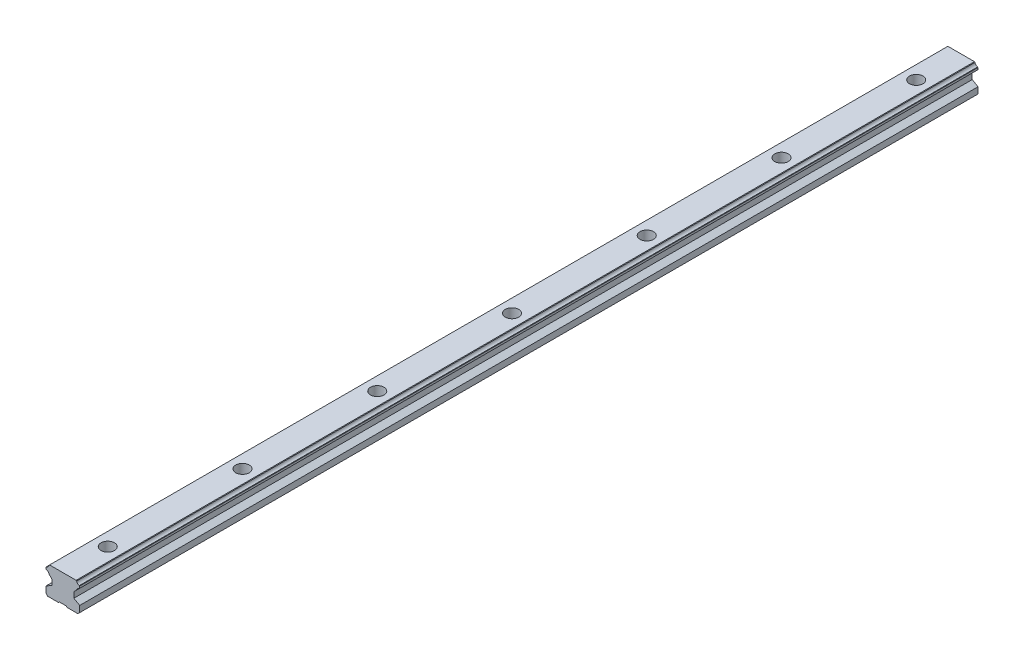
ISO-10303-21;
HEADER;
FILE_DESCRIPTION(('STEP AP214'),'2;1');
FILE_NAME('part.step','',(''),(''),'','','');
FILE_SCHEMA(('AUTOMOTIVE_DESIGN { 1 0 10303 214 1 1 1 1 }'));
ENDSEC;
DATA;
#1=APPLICATION_CONTEXT('core data for automotive mechanical design processes');
#2=APPLICATION_PROTOCOL_DEFINITION('international standard','automotive_design',2000,#1);
#3=PRODUCT_CONTEXT('',#1,'mechanical');
#4=PRODUCT('Part','Part','',(#3));
#5=PRODUCT_RELATED_PRODUCT_CATEGORY('part','',(#4));
#6=PRODUCT_DEFINITION_FORMATION('','',#4);
#7=PRODUCT_DEFINITION_CONTEXT('part definition',#1,'design');
#8=PRODUCT_DEFINITION('design','',#6,#7);
#9=PRODUCT_DEFINITION_SHAPE('','',#8);
#10=(LENGTH_UNIT() NAMED_UNIT(*) SI_UNIT(.MILLI.,.METRE.));
#11=(NAMED_UNIT(*) PLANE_ANGLE_UNIT() SI_UNIT($,.RADIAN.));
#12=(NAMED_UNIT(*) SI_UNIT($,.STERADIAN.) SOLID_ANGLE_UNIT());
#13=UNCERTAINTY_MEASURE_WITH_UNIT(LENGTH_MEASURE(1.E-05),#10,'distance_accuracy_value','');
#14=(GEOMETRIC_REPRESENTATION_CONTEXT(3) GLOBAL_UNCERTAINTY_ASSIGNED_CONTEXT((#13)) GLOBAL_UNIT_ASSIGNED_CONTEXT((#10,
#11,#12)) REPRESENTATION_CONTEXT('',''));
#15=CARTESIAN_POINT('',(0.,0.,0.));
#16=DIRECTION('',(0.,0.,1.));
#17=DIRECTION('',(1.,0.,0.));
#18=AXIS2_PLACEMENT_3D('',#15,#16,#17);
#19=CARTESIAN_POINT('',(7.42999904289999,-13.8860808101,-400.));
#20=DIRECTION('',(1.,0.,0.));
#21=DIRECTION('',(0.,0.,-1.));
#22=AXIS2_PLACEMENT_3D('',#19,#20,#21);
#23=PLANE('',#22);
#24=DIRECTION('',(0.,1.,0.));
#25=VECTOR('',#24,1.);
#26=CARTESIAN_POINT('',(7.42999904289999,-13.8860808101,-400.));
#27=LINE('',#26,#25);
#28=CARTESIAN_POINT('',(7.42999904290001,-13.8860808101,-400.));
#29=VERTEX_POINT('',#28);
#30=CARTESIAN_POINT('',(7.42999904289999,-13.0139191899,-400.));
#31=VERTEX_POINT('',#30);
#32=EDGE_CURVE('E377',#29,#31,#27,.T.);
#33=ORIENTED_EDGE('',*,*,#32,.T.);
#34=DIRECTION('',(0.,0.,1.));
#35=VECTOR('',#34,1.);
#36=CARTESIAN_POINT('',(7.42999904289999,-13.0139191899,-400.));
#37=LINE('',#36,#35);
#38=CARTESIAN_POINT('',(7.42999904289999,-13.0139191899,0.));
#39=VERTEX_POINT('',#38);
#40=EDGE_CURVE('E408',#39,#31,#37,.F.);
#41=ORIENTED_EDGE('',*,*,#40,.F.);
#42=DIRECTION('',(0.,1.,0.));
#43=VECTOR('',#42,1.);
#44=CARTESIAN_POINT('',(7.42999904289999,-13.8860808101,0.));
#45=LINE('',#44,#43);
#46=CARTESIAN_POINT('',(7.42999904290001,-13.8860808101,0.));
#47=VERTEX_POINT('',#46);
#48=EDGE_CURVE('E416',#39,#47,#45,.F.);
#49=ORIENTED_EDGE('',*,*,#48,.T.);
#50=DIRECTION('',(0.,0.,1.));
#51=VECTOR('',#50,1.);
#52=CARTESIAN_POINT('',(7.42999904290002,-13.8860808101,-400.));
#53=LINE('',#52,#51);
#54=EDGE_CURVE('E444',#29,#47,#53,.T.);
#55=ORIENTED_EDGE('',*,*,#54,.F.);
#56=EDGE_LOOP('',(#33,#41,#49,#55));
#57=FACE_BOUND('',#56,.T.);
#58=ADVANCED_FACE('F16',(#57),#23,.T.);
#59=CARTESIAN_POINT('',(-7.4299994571,-13.0139191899,-400.));
#60=DIRECTION('',(-1.,0.,0.));
#61=DIRECTION('',(0.,0.,1.));
#62=AXIS2_PLACEMENT_3D('',#59,#60,#61);
#63=PLANE('',#62);
#64=DIRECTION('',(0.,1.,0.));
#65=VECTOR('',#64,1.);
#66=CARTESIAN_POINT('',(-7.4299994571,-13.0139191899,-400.));
#67=LINE('',#66,#65);
#68=CARTESIAN_POINT('',(-7.4299994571,-13.0139191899,-400.));
#69=VERTEX_POINT('',#68);
#70=CARTESIAN_POINT('',(-7.4299994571,-13.8860808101,-400.));
#71=VERTEX_POINT('',#70);
#72=EDGE_CURVE('E258',#69,#71,#67,.F.);
#73=ORIENTED_EDGE('',*,*,#72,.T.);
#74=DIRECTION('',(0.,0.,1.));
#75=VECTOR('',#74,1.);
#76=CARTESIAN_POINT('',(-7.4299994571,-13.8860808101,-400.));
#77=LINE('',#76,#75);
#78=CARTESIAN_POINT('',(-7.4299994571,-13.8860808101,2.59052039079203E-13));
#79=VERTEX_POINT('',#78);
#80=EDGE_CURVE('E401',#79,#71,#77,.F.);
#81=ORIENTED_EDGE('',*,*,#80,.F.);
#82=DIRECTION('',(0.,1.,0.));
#83=VECTOR('',#82,1.);
#84=CARTESIAN_POINT('',(-7.4299994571,-13.0139191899,0.));
#85=LINE('',#84,#83);
#86=CARTESIAN_POINT('',(-7.4299994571,-13.0139191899,0.));
#87=VERTEX_POINT('',#86);
#88=EDGE_CURVE('E372',#79,#87,#85,.T.);
#89=ORIENTED_EDGE('',*,*,#88,.T.);
#90=DIRECTION('',(0.,0.,1.));
#91=VECTOR('',#90,1.);
#92=CARTESIAN_POINT('',(-7.42999945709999,-13.0139191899,-400.));
#93=LINE('',#92,#91);
#94=EDGE_CURVE('E365',#69,#87,#93,.T.);
#95=ORIENTED_EDGE('',*,*,#94,.F.);
#96=EDGE_LOOP('',(#73,#81,#89,#95));
#97=FACE_BOUND('',#96,.T.);
#98=ADVANCED_FACE('F882',(#97),#63,.T.);
#99=CARTESIAN_POINT('',(-1.50000095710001,-23.6,-400.));
#100=DIRECTION('',(0.,-1.,0.));
#101=DIRECTION('',(0.,0.,-1.));
#102=AXIS2_PLACEMENT_3D('',#99,#100,#101);
#103=PLANE('',#102);
#104=DIRECTION('',(0.,0.,1.));
#105=VECTOR('',#104,1.);
#106=CARTESIAN_POINT('',(1.5000005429,-23.6,-400.));
#107=LINE('',#106,#105);
#108=CARTESIAN_POINT('',(1.5000005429,-23.6,-20.9013869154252));
#109=VERTEX_POINT('',#108);
#110=CARTESIAN_POINT('',(1.5000005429,-23.6,-79.0986130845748));
#111=VERTEX_POINT('',#110);
#112=EDGE_CURVE('E315',#109,#111,#107,.F.);
#113=ORIENTED_EDGE('',*,*,#112,.F.);
#114=CARTESIAN_POINT('',(0.,-23.6,-20.));
#115=DIRECTION('',(0.,1.,0.));
#116=DIRECTION('',(0.,0.,1.));
#117=AXIS2_PLACEMENT_3D('',#114,#115,#116);
#118=CIRCLE('',#117,1.75);
#119=CARTESIAN_POINT('',(-1.50000095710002,-23.6,-20.9013862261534));
#120=VERTEX_POINT('',#119);
#121=EDGE_CURVE('E599',#109,#120,#118,.T.);
#122=ORIENTED_EDGE('',*,*,#121,.T.);
#123=DIRECTION('',(0.,0.,1.));
#124=VECTOR('',#123,1.);
#125=CARTESIAN_POINT('',(-1.50000095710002,-23.6,-400.));
#126=LINE('',#125,#124);
#127=CARTESIAN_POINT('',(-1.50000095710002,-23.6,-79.0986137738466));
#128=VERTEX_POINT('',#127);
#129=EDGE_CURVE('E318',#128,#120,#126,.T.);
#130=ORIENTED_EDGE('',*,*,#129,.F.);
#131=CARTESIAN_POINT('',(0.,-23.6,-80.));
#132=DIRECTION('',(0.,1.,0.));
#133=DIRECTION('',(0.,0.,1.));
#134=AXIS2_PLACEMENT_3D('',#131,#132,#133);
#135=CIRCLE('',#134,1.75);
#136=EDGE_CURVE('E283',#128,#111,#135,.T.);
#137=ORIENTED_EDGE('',*,*,#136,.T.);
#138=EDGE_LOOP('',(#113,#122,#130,#137));
#139=FACE_BOUND('',#138,.T.);
#140=ADVANCED_FACE('F679',(#139),#103,.T.);
#141=CARTESIAN_POINT('',(-1.50000095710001,-23.6,-400.));
#142=DIRECTION('',(0.,-1.,0.));
#143=DIRECTION('',(0.,0.,-1.));
#144=AXIS2_PLACEMENT_3D('',#141,#142,#143);
#145=PLANE('',#144);
#146=DIRECTION('',(0.,0.,1.));
#147=VECTOR('',#146,1.);
#148=CARTESIAN_POINT('',(1.5000005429,-23.6,-400.));
#149=LINE('',#148,#147);
#150=CARTESIAN_POINT('',(1.5000005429,-23.6,-80.9013869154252));
#151=VERTEX_POINT('',#150);
#152=CARTESIAN_POINT('',(1.5000005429,-23.6,-139.098613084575));
#153=VERTEX_POINT('',#152);
#154=EDGE_CURVE('E314',#151,#153,#149,.F.);
#155=ORIENTED_EDGE('',*,*,#154,.F.);
#156=CARTESIAN_POINT('',(0.,-23.6,-80.));
#157=DIRECTION('',(0.,1.,0.));
#158=DIRECTION('',(0.,0.,1.));
#159=AXIS2_PLACEMENT_3D('',#156,#157,#158);
#160=CIRCLE('',#159,1.75);
#161=CARTESIAN_POINT('',(-1.50000095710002,-23.6,-80.9013862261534));
#162=VERTEX_POINT('',#161);
#163=EDGE_CURVE('E280',#151,#162,#160,.T.);
#164=ORIENTED_EDGE('',*,*,#163,.T.);
#165=DIRECTION('',(0.,0.,1.));
#166=VECTOR('',#165,1.);
#167=CARTESIAN_POINT('',(-1.50000095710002,-23.6,-400.));
#168=LINE('',#167,#166);
#169=CARTESIAN_POINT('',(-1.50000095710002,-23.6,-139.098613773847));
#170=VERTEX_POINT('',#169);
#171=EDGE_CURVE('E319',#170,#162,#168,.T.);
#172=ORIENTED_EDGE('',*,*,#171,.F.);
#173=CARTESIAN_POINT('',(0.,-23.6,-140.));
#174=DIRECTION('',(0.,1.,0.));
#175=DIRECTION('',(0.,0.,1.));
#176=AXIS2_PLACEMENT_3D('',#173,#174,#175);
#177=CIRCLE('',#176,1.75);
#178=EDGE_CURVE('E595',#170,#153,#177,.T.);
#179=ORIENTED_EDGE('',*,*,#178,.T.);
#180=EDGE_LOOP('',(#155,#164,#172,#179));
#181=FACE_BOUND('',#180,.T.);
#182=ADVANCED_FACE('F684',(#181),#145,.T.);
#183=CARTESIAN_POINT('',(-1.50000095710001,-23.6,-400.));
#184=DIRECTION('',(0.,-1.,0.));
#185=DIRECTION('',(0.,0.,-1.));
#186=AXIS2_PLACEMENT_3D('',#183,#184,#185);
#187=PLANE('',#186);
#188=DIRECTION('',(0.,0.,1.));
#189=VECTOR('',#188,1.);
#190=CARTESIAN_POINT('',(1.5000005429,-23.6,-400.));
#191=LINE('',#190,#189);
#192=CARTESIAN_POINT('',(1.5000005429,-23.6,-140.901386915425));
#193=VERTEX_POINT('',#192);
#194=CARTESIAN_POINT('',(1.5000005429,-23.6,-199.098613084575));
#195=VERTEX_POINT('',#194);
#196=EDGE_CURVE('E311',#193,#195,#191,.F.);
#197=ORIENTED_EDGE('',*,*,#196,.F.);
#198=CARTESIAN_POINT('',(0.,-23.6,-140.));
#199=DIRECTION('',(0.,1.,0.));
#200=DIRECTION('',(0.,0.,1.));
#201=AXIS2_PLACEMENT_3D('',#198,#199,#200);
#202=CIRCLE('',#201,1.75);
#203=CARTESIAN_POINT('',(-1.50000095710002,-23.6,-140.901386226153));
#204=VERTEX_POINT('',#203);
#205=EDGE_CURVE('E589',#193,#204,#202,.T.);
#206=ORIENTED_EDGE('',*,*,#205,.T.);
#207=DIRECTION('',(0.,0.,1.));
#208=VECTOR('',#207,1.);
#209=CARTESIAN_POINT('',(-1.50000095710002,-23.6,-400.));
#210=LINE('',#209,#208);
#211=CARTESIAN_POINT('',(-1.50000095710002,-23.6,-199.098613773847));
#212=VERTEX_POINT('',#211);
#213=EDGE_CURVE('E324',#212,#204,#210,.T.);
#214=ORIENTED_EDGE('',*,*,#213,.F.);
#215=CARTESIAN_POINT('',(0.,-23.6,-200.));
#216=DIRECTION('',(0.,1.,0.));
#217=DIRECTION('',(0.,0.,1.));
#218=AXIS2_PLACEMENT_3D('',#215,#216,#217);
#219=CIRCLE('',#218,1.75);
#220=EDGE_CURVE('E287',#212,#195,#219,.T.);
#221=ORIENTED_EDGE('',*,*,#220,.T.);
#222=EDGE_LOOP('',(#197,#206,#214,#221));
#223=FACE_BOUND('',#222,.T.);
#224=ADVANCED_FACE('F693',(#223),#187,.T.);
#225=CARTESIAN_POINT('',(-1.50000095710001,-23.6,-400.));
#226=DIRECTION('',(0.,-1.,0.));
#227=DIRECTION('',(0.,0.,-1.));
#228=AXIS2_PLACEMENT_3D('',#225,#226,#227);
#229=PLANE('',#228);
#230=DIRECTION('',(0.,0.,1.));
#231=VECTOR('',#230,1.);
#232=CARTESIAN_POINT('',(1.5000005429,-23.6,-400.));
#233=LINE('',#232,#231);
#234=CARTESIAN_POINT('',(1.5000005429,-23.6,-200.901386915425));
#235=VERTEX_POINT('',#234);
#236=CARTESIAN_POINT('',(1.5000005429,-23.6,-259.098613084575));
#237=VERTEX_POINT('',#236);
#238=EDGE_CURVE('E302',#235,#237,#233,.F.);
#239=ORIENTED_EDGE('',*,*,#238,.F.);
#240=CARTESIAN_POINT('',(0.,-23.6,-200.));
#241=DIRECTION('',(0.,1.,0.));
#242=DIRECTION('',(0.,0.,1.));
#243=AXIS2_PLACEMENT_3D('',#240,#241,#242);
#244=CIRCLE('',#243,1.75);
#245=CARTESIAN_POINT('',(-1.50000095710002,-23.6,-200.901386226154));
#246=VERTEX_POINT('',#245);
#247=EDGE_CURVE('E285',#235,#246,#244,.T.);
#248=ORIENTED_EDGE('',*,*,#247,.T.);
#249=DIRECTION('',(0.,0.,1.));
#250=VECTOR('',#249,1.);
#251=CARTESIAN_POINT('',(-1.50000095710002,-23.6,-400.));
#252=LINE('',#251,#250);
#253=CARTESIAN_POINT('',(-1.50000095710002,-23.6,-259.098613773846));
#254=VERTEX_POINT('',#253);
#255=EDGE_CURVE('E267',#254,#246,#252,.T.);
#256=ORIENTED_EDGE('',*,*,#255,.F.);
#257=CARTESIAN_POINT('',(0.,-23.6,-260.));
#258=DIRECTION('',(0.,1.,0.));
#259=DIRECTION('',(0.,0.,1.));
#260=AXIS2_PLACEMENT_3D('',#257,#258,#259);
#261=CIRCLE('',#260,1.74999999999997);
#262=EDGE_CURVE('E585',#254,#237,#261,.T.);
#263=ORIENTED_EDGE('',*,*,#262,.T.);
#264=EDGE_LOOP('',(#239,#248,#256,#263));
#265=FACE_BOUND('',#264,.T.);
#266=ADVANCED_FACE('F702',(#265),#229,.T.);
#267=CARTESIAN_POINT('',(-1.50000095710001,-23.6,-400.));
#268=DIRECTION('',(0.,-1.,0.));
#269=DIRECTION('',(0.,0.,-1.));
#270=AXIS2_PLACEMENT_3D('',#267,#268,#269);
#271=PLANE('',#270);
#272=DIRECTION('',(0.,0.,1.));
#273=VECTOR('',#272,1.);
#274=CARTESIAN_POINT('',(1.5000005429,-23.6,-400.));
#275=LINE('',#274,#273);
#276=CARTESIAN_POINT('',(1.5000005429,-23.6,-260.901386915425));
#277=VERTEX_POINT('',#276);
#278=CARTESIAN_POINT('',(1.5000005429,-23.6,-319.098613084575));
#279=VERTEX_POINT('',#278);
#280=EDGE_CURVE('E296',#277,#279,#275,.F.);
#281=ORIENTED_EDGE('',*,*,#280,.F.);
#282=CARTESIAN_POINT('',(0.,-23.6,-260.));
#283=DIRECTION('',(0.,1.,0.));
#284=DIRECTION('',(0.,0.,1.));
#285=AXIS2_PLACEMENT_3D('',#282,#283,#284);
#286=CIRCLE('',#285,1.74999999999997);
#287=CARTESIAN_POINT('',(-1.50000095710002,-23.6,-260.901386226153));
#288=VERTEX_POINT('',#287);
#289=EDGE_CURVE('E263',#277,#288,#286,.T.);
#290=ORIENTED_EDGE('',*,*,#289,.T.);
#291=DIRECTION('',(0.,0.,1.));
#292=VECTOR('',#291,1.);
#293=CARTESIAN_POINT('',(-1.50000095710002,-23.6,-400.));
#294=LINE('',#293,#292);
#295=CARTESIAN_POINT('',(-1.50000095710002,-23.6,-319.098613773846));
#296=VERTEX_POINT('',#295);
#297=EDGE_CURVE('E260',#296,#288,#294,.T.);
#298=ORIENTED_EDGE('',*,*,#297,.F.);
#299=CARTESIAN_POINT('',(0.,-23.6,-320.));
#300=DIRECTION('',(0.,1.,0.));
#301=DIRECTION('',(0.,0.,1.));
#302=AXIS2_PLACEMENT_3D('',#299,#300,#301);
#303=CIRCLE('',#302,1.74999999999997);
#304=EDGE_CURVE('E19',#296,#279,#303,.T.);
#305=ORIENTED_EDGE('',*,*,#304,.T.);
#306=EDGE_LOOP('',(#281,#290,#298,#305));
#307=FACE_BOUND('',#306,.T.);
#308=ADVANCED_FACE('F261',(#307),#271,.T.);
#309=CARTESIAN_POINT('',(-1.50000095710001,-23.6,-400.));
#310=DIRECTION('',(0.,-1.,0.));
#311=DIRECTION('',(0.,0.,-1.));
#312=AXIS2_PLACEMENT_3D('',#309,#310,#311);
#313=PLANE('',#312);
#314=DIRECTION('',(0.,0.,1.));
#315=VECTOR('',#314,1.);
#316=CARTESIAN_POINT('',(1.5000005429,-23.6,-400.));
#317=LINE('',#316,#315);
#318=CARTESIAN_POINT('',(1.5000005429,-23.6,-320.901386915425));
#319=VERTEX_POINT('',#318);
#320=CARTESIAN_POINT('',(1.5000005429,-23.6,-379.098613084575));
#321=VERTEX_POINT('',#320);
#322=EDGE_CURVE('E291',#319,#321,#317,.F.);
#323=ORIENTED_EDGE('',*,*,#322,.F.);
#324=CARTESIAN_POINT('',(0.,-23.6,-320.));
#325=DIRECTION('',(0.,1.,0.));
#326=DIRECTION('',(0.,0.,1.));
#327=AXIS2_PLACEMENT_3D('',#324,#325,#326);
#328=CIRCLE('',#327,1.74999999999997);
#329=CARTESIAN_POINT('',(-1.50000095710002,-23.6,-320.901386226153));
#330=VERTEX_POINT('',#329);
#331=EDGE_CURVE('E257',#319,#330,#328,.T.);
#332=ORIENTED_EDGE('',*,*,#331,.T.);
#333=DIRECTION('',(0.,0.,1.));
#334=VECTOR('',#333,1.);
#335=CARTESIAN_POINT('',(-1.50000095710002,-23.6,-400.));
#336=LINE('',#335,#334);
#337=CARTESIAN_POINT('',(-1.50000095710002,-23.6,-379.098613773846));
#338=VERTEX_POINT('',#337);
#339=EDGE_CURVE('E272',#338,#330,#336,.T.);
#340=ORIENTED_EDGE('',*,*,#339,.F.);
#341=CARTESIAN_POINT('',(0.,-23.6,-380.));
#342=DIRECTION('',(0.,1.,0.));
#343=DIRECTION('',(0.,0.,1.));
#344=AXIS2_PLACEMENT_3D('',#341,#342,#343);
#345=CIRCLE('',#344,1.75000000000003);
#346=EDGE_CURVE('E578',#338,#321,#345,.T.);
#347=ORIENTED_EDGE('',*,*,#346,.T.);
#348=EDGE_LOOP('',(#323,#332,#340,#347));
#349=FACE_BOUND('',#348,.T.);
#350=ADVANCED_FACE('F289',(#349),#313,.T.);
#351=CARTESIAN_POINT('',(0.,-24.,-320.));
#352=DIRECTION('',(0.,1.,0.));
#353=DIRECTION('',(0.,0.,1.));
#354=AXIS2_PLACEMENT_3D('',#351,#352,#353);
#355=CYLINDRICAL_SURFACE('',#354,1.74999999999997);
#356=CARTESIAN_POINT('',(0.,-16.,-320.));
#357=DIRECTION('',(0.,1.,0.));
#358=DIRECTION('',(0.,0.,1.));
#359=AXIS2_PLACEMENT_3D('',#356,#357,#358);
#360=CIRCLE('',#359,1.74999999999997);
#361=CARTESIAN_POINT('',(0.,-16.,-318.25));
#362=VERTEX_POINT('',#361);
#363=EDGE_CURVE('E573',#362,#362,#360,.F.);
#364=ORIENTED_EDGE('',*,*,#363,.F.);
#365=EDGE_LOOP('',(#364));
#366=FACE_BOUND('',#365,.T.);
#367=CARTESIAN_POINT('',(0.,-22.0999994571,-320.));
#368=DIRECTION('',(-0.707106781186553,-0.707106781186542,0.));
#369=DIRECTION('',(-0.707106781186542,0.707106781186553,0.));
#370=AXIS2_PLACEMENT_3D('',#367,#368,#369);
#371=ELLIPSE('',#370,2.4748737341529,1.74999999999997);
#372=EDGE_CURVE('E254',#279,#319,#371,.F.);
#373=ORIENTED_EDGE('',*,*,#372,.F.);
#374=ORIENTED_EDGE('',*,*,#304,.F.);
#375=CARTESIAN_POINT('',(0.,-22.0999952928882,-320.));
#376=DIRECTION('',(0.70710766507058,-0.707105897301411,0.));
#377=DIRECTION('',(0.707105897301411,0.70710766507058,0.));
#378=AXIS2_PLACEMENT_3D('',#375,#376,#377);
#379=ELLIPSE('',#378,2.47487682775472,1.74999999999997);
#380=EDGE_CURVE('E251',#330,#296,#379,.F.);
#381=ORIENTED_EDGE('',*,*,#380,.F.);
#382=ORIENTED_EDGE('',*,*,#331,.F.);
#383=EDGE_LOOP('',(#373,#374,#381,#382));
#384=FACE_BOUND('',#383,.T.);
#385=ADVANCED_FACE('F248',(#366,#384),#355,.F.);
#386=CARTESIAN_POINT('',(0.,-24.,-200.));
#387=DIRECTION('',(0.,1.,0.));
#388=DIRECTION('',(0.,0.,1.));
#389=AXIS2_PLACEMENT_3D('',#386,#387,#388);
#390=CYLINDRICAL_SURFACE('',#389,1.75);
#391=CARTESIAN_POINT('',(0.,-16.,-200.));
#392=DIRECTION('',(0.,1.,0.));
#393=DIRECTION('',(0.,0.,1.));
#394=AXIS2_PLACEMENT_3D('',#391,#392,#393);
#395=CIRCLE('',#394,1.75);
#396=CARTESIAN_POINT('',(0.,-16.,-198.25));
#397=VERTEX_POINT('',#396);
#398=EDGE_CURVE('E570',#397,#397,#395,.F.);
#399=ORIENTED_EDGE('',*,*,#398,.F.);
#400=EDGE_LOOP('',(#399));
#401=FACE_BOUND('',#400,.T.);
#402=CARTESIAN_POINT('',(0.,-22.0999994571,-200.));
#403=DIRECTION('',(-0.707106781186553,-0.707106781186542,0.));
#404=DIRECTION('',(-0.707106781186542,0.707106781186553,0.));
#405=AXIS2_PLACEMENT_3D('',#402,#403,#404);
#406=ELLIPSE('',#405,2.47487373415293,1.75);
#407=EDGE_CURVE('E308',#195,#235,#406,.F.);
#408=ORIENTED_EDGE('',*,*,#407,.F.);
#409=ORIENTED_EDGE('',*,*,#220,.F.);
#410=CARTESIAN_POINT('',(0.,-22.0999952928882,-200.));
#411=DIRECTION('',(0.70710766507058,-0.707105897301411,0.));
#412=DIRECTION('',(0.707105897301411,0.70710766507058,0.));
#413=AXIS2_PLACEMENT_3D('',#410,#411,#412);
#414=ELLIPSE('',#413,2.47487682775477,1.75);
#415=EDGE_CURVE('E278',#246,#212,#414,.F.);
#416=ORIENTED_EDGE('',*,*,#415,.F.);
#417=ORIENTED_EDGE('',*,*,#247,.F.);
#418=EDGE_LOOP('',(#408,#409,#416,#417));
#419=FACE_BOUND('',#418,.T.);
#420=ADVANCED_FACE('F699',(#401,#419),#390,.F.);
#421=CARTESIAN_POINT('',(0.,-24.,-80.));
#422=DIRECTION('',(0.,1.,0.));
#423=DIRECTION('',(0.,0.,1.));
#424=AXIS2_PLACEMENT_3D('',#421,#422,#423);
#425=CYLINDRICAL_SURFACE('',#424,1.75);
#426=CARTESIAN_POINT('',(0.,-16.,-80.));
#427=DIRECTION('',(0.,1.,0.));
#428=DIRECTION('',(0.,0.,1.));
#429=AXIS2_PLACEMENT_3D('',#426,#427,#428);
#430=CIRCLE('',#429,1.75);
#431=CARTESIAN_POINT('',(0.,-16.,-78.25));
#432=VERTEX_POINT('',#431);
#433=EDGE_CURVE('E567',#432,#432,#430,.F.);
#434=ORIENTED_EDGE('',*,*,#433,.F.);
#435=EDGE_LOOP('',(#434));
#436=FACE_BOUND('',#435,.T.);
#437=CARTESIAN_POINT('',(0.,-22.0999994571,-80.));
#438=DIRECTION('',(-0.707106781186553,-0.707106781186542,0.));
#439=DIRECTION('',(-0.707106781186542,0.707106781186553,0.));
#440=AXIS2_PLACEMENT_3D('',#437,#438,#439);
#441=ELLIPSE('',#440,2.47487373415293,1.75);
#442=EDGE_CURVE('E312',#111,#151,#441,.F.);
#443=ORIENTED_EDGE('',*,*,#442,.F.);
#444=ORIENTED_EDGE('',*,*,#136,.F.);
#445=CARTESIAN_POINT('',(0.,-22.0999952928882,-80.));
#446=DIRECTION('',(0.70710766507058,-0.707105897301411,0.));
#447=DIRECTION('',(0.707105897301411,0.70710766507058,0.));
#448=AXIS2_PLACEMENT_3D('',#445,#446,#447);
#449=ELLIPSE('',#448,2.47487682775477,1.75);
#450=EDGE_CURVE('E316',#162,#128,#449,.F.);
#451=ORIENTED_EDGE('',*,*,#450,.F.);
#452=ORIENTED_EDGE('',*,*,#163,.F.);
#453=EDGE_LOOP('',(#443,#444,#451,#452));
#454=FACE_BOUND('',#453,.T.);
#455=ADVANCED_FACE('F681',(#436,#454),#425,.F.);
#456=CARTESIAN_POINT('',(-7.49999945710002,-23.2,-400.));
#457=DIRECTION('',(-0.707106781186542,-0.707106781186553,0.));
#458=DIRECTION('',(0.707106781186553,-0.707106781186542,0.));
#459=AXIS2_PLACEMENT_3D('',#456,#457,#458);
#460=PLANE('',#459);
#461=DIRECTION('',(0.707106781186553,-0.707106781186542,0.));
#462=VECTOR('',#461,1.);
#463=CARTESIAN_POINT('',(-7.49999945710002,-23.2,-400.));
#464=LINE('',#463,#462);
#465=CARTESIAN_POINT('',(-7.49999945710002,-23.2,-400.));
#466=VERTEX_POINT('',#465);
#467=CARTESIAN_POINT('',(-6.69999945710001,-24.,-400.));
#468=VERTEX_POINT('',#467);
#469=EDGE_CURVE('E274',#466,#468,#464,.T.);
#470=ORIENTED_EDGE('',*,*,#469,.T.);
#471=DIRECTION('',(0.,0.,-1.));
#472=VECTOR('',#471,1.);
#473=CARTESIAN_POINT('',(-6.69999945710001,-24.,-400.));
#474=LINE('',#473,#472);
#475=CARTESIAN_POINT('',(-6.69999945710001,-24.,0.));
#476=VERTEX_POINT('',#475);
#477=EDGE_CURVE('E472',#476,#468,#474,.T.);
#478=ORIENTED_EDGE('',*,*,#477,.F.);
#479=DIRECTION('',(0.707106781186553,-0.707106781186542,0.));
#480=VECTOR('',#479,1.);
#481=CARTESIAN_POINT('',(-7.49999945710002,-23.2,0.));
#482=LINE('',#481,#480);
#483=CARTESIAN_POINT('',(-7.49999945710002,-23.2,0.));
#484=VERTEX_POINT('',#483);
#485=EDGE_CURVE('E282',#476,#484,#482,.F.);
#486=ORIENTED_EDGE('',*,*,#485,.T.);
#487=DIRECTION('',(0.,0.,1.));
#488=VECTOR('',#487,1.);
#489=CARTESIAN_POINT('',(-7.49999945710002,-23.2,-400.));
#490=LINE('',#489,#488);
#491=EDGE_CURVE('E977',#466,#484,#490,.T.);
#492=ORIENTED_EDGE('',*,*,#491,.F.);
#493=EDGE_LOOP('',(#470,#478,#486,#492));
#494=FACE_BOUND('',#493,.T.);
#495=ADVANCED_FACE('F1093',(#494),#460,.T.);
#496=CARTESIAN_POINT('',(-1.89999995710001,-24.,-400.));
#497=DIRECTION('',(0.70710766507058,-0.707105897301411,0.));
#498=DIRECTION('',(0.707105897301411,0.70710766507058,0.));
#499=AXIS2_PLACEMENT_3D('',#496,#497,#498);
#500=PLANE('',#499);
#501=DIRECTION('',(0.,0.,-1.));
#502=VECTOR('',#501,1.);
#503=CARTESIAN_POINT('',(-1.89999995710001,-24.,-400.));
#504=LINE('',#503,#502);
#505=CARTESIAN_POINT('',(-1.89999995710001,-24.,-400.));
#506=VERTEX_POINT('',#505);
#507=CARTESIAN_POINT('',(-1.89999995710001,-24.,0.));
#508=VERTEX_POINT('',#507);
#509=EDGE_CURVE('E468',#506,#508,#504,.F.);
#510=ORIENTED_EDGE('',*,*,#509,.F.);
#511=DIRECTION('',(0.707105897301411,0.70710766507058,0.));
#512=VECTOR('',#511,1.);
#513=CARTESIAN_POINT('',(-1.89999995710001,-24.,-400.));
#514=LINE('',#513,#512);
#515=CARTESIAN_POINT('',(-1.50000095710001,-23.6,-400.));
#516=VERTEX_POINT('',#515);
#517=EDGE_CURVE('E332',#506,#516,#514,.T.);
#518=ORIENTED_EDGE('',*,*,#517,.T.);
#519=DIRECTION('',(0.,0.,-1.));
#520=VECTOR('',#519,1.);
#521=CARTESIAN_POINT('',(-1.50000095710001,-23.6,-400.));
#522=LINE('',#521,#520);
#523=CARTESIAN_POINT('',(-1.50000095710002,-23.6,-380.901386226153));
#524=VERTEX_POINT('',#523);
#525=EDGE_CURVE('E455',#524,#516,#522,.T.);
#526=ORIENTED_EDGE('',*,*,#525,.F.);
#527=CARTESIAN_POINT('',(0.,-22.0999952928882,-380.));
#528=DIRECTION('',(0.70710766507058,-0.707105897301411,0.));
#529=DIRECTION('',(0.707105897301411,0.70710766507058,0.));
#530=AXIS2_PLACEMENT_3D('',#527,#528,#529);
#531=ELLIPSE('',#530,2.47487682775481,1.75000000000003);
#532=EDGE_CURVE('E580',#524,#338,#531,.F.);
#533=ORIENTED_EDGE('',*,*,#532,.T.);
#534=ORIENTED_EDGE('',*,*,#339,.T.);
#535=ORIENTED_EDGE('',*,*,#380,.T.);
#536=ORIENTED_EDGE('',*,*,#297,.T.);
#537=CARTESIAN_POINT('',(0.,-22.0999952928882,-260.));
#538=DIRECTION('',(0.70710766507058,-0.707105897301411,0.));
#539=DIRECTION('',(0.707105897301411,0.70710766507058,0.));
#540=AXIS2_PLACEMENT_3D('',#537,#538,#539);
#541=ELLIPSE('',#540,2.47487682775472,1.74999999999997);
#542=EDGE_CURVE('E587',#288,#254,#541,.F.);
#543=ORIENTED_EDGE('',*,*,#542,.T.);
#544=ORIENTED_EDGE('',*,*,#255,.T.);
#545=ORIENTED_EDGE('',*,*,#415,.T.);
#546=ORIENTED_EDGE('',*,*,#213,.T.);
#547=CARTESIAN_POINT('',(0.,-22.0999952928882,-140.));
#548=DIRECTION('',(0.70710766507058,-0.707105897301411,0.));
#549=DIRECTION('',(0.707105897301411,0.70710766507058,0.));
#550=AXIS2_PLACEMENT_3D('',#547,#548,#549);
#551=ELLIPSE('',#550,2.47487682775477,1.75);
#552=EDGE_CURVE('E597',#204,#170,#551,.F.);
#553=ORIENTED_EDGE('',*,*,#552,.T.);
#554=ORIENTED_EDGE('',*,*,#171,.T.);
#555=ORIENTED_EDGE('',*,*,#450,.T.);
#556=ORIENTED_EDGE('',*,*,#129,.T.);
#557=CARTESIAN_POINT('',(0.,-22.0999952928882,-20.));
#558=DIRECTION('',(0.70710766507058,-0.707105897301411,0.));
#559=DIRECTION('',(0.707105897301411,0.70710766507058,0.));
#560=AXIS2_PLACEMENT_3D('',#557,#558,#559);
#561=ELLIPSE('',#560,2.47487682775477,1.75);
#562=CARTESIAN_POINT('',(-1.50000095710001,-23.6,-19.0986137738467));
#563=VERTEX_POINT('',#562);
#564=EDGE_CURVE('E306',#120,#563,#561,.F.);
#565=ORIENTED_EDGE('',*,*,#564,.T.);
#566=DIRECTION('',(0.,0.,-1.));
#567=VECTOR('',#566,1.);
#568=CARTESIAN_POINT('',(-1.50000095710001,-23.6,-400.));
#569=LINE('',#568,#567);
#570=CARTESIAN_POINT('',(-1.50000095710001,-23.6,0.));
#571=VERTEX_POINT('',#570);
#572=EDGE_CURVE('E566',#571,#563,#569,.T.);
#573=ORIENTED_EDGE('',*,*,#572,.F.);
#574=DIRECTION('',(0.707105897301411,0.70710766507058,0.));
#575=VECTOR('',#574,1.);
#576=CARTESIAN_POINT('',(-1.89999995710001,-24.,0.));
#577=LINE('',#576,#575);
#578=EDGE_CURVE('E322',#571,#508,#577,.F.);
#579=ORIENTED_EDGE('',*,*,#578,.T.);
#580=EDGE_LOOP('',(#510,#518,#526,#533,#534,#535,#536,#543,#544,#545,#546,#553,#554,#555,#556,
#565,#573,#579));
#581=FACE_BOUND('',#580,.T.);
#582=ADVANCED_FACE('F270',(#581),#500,.T.);
#583=CARTESIAN_POINT('',(1.5000005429,-23.6,-400.));
#584=DIRECTION('',(-0.707106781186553,-0.707106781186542,0.));
#585=DIRECTION('',(0.707106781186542,-0.707106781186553,0.));
#586=AXIS2_PLACEMENT_3D('',#583,#584,#585);
#587=PLANE('',#586);
#588=ORIENTED_EDGE('',*,*,#280,.T.);
#589=ORIENTED_EDGE('',*,*,#372,.T.);
#590=ORIENTED_EDGE('',*,*,#322,.T.);
#591=CARTESIAN_POINT('',(0.,-22.0999994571,-380.));
#592=DIRECTION('',(-0.707106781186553,-0.707106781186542,0.));
#593=DIRECTION('',(-0.707106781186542,0.707106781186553,0.));
#594=AXIS2_PLACEMENT_3D('',#591,#592,#593);
#595=ELLIPSE('',#594,2.47487373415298,1.75000000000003);
#596=CARTESIAN_POINT('',(1.5000005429,-23.6,-380.901386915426));
#597=VERTEX_POINT('',#596);
#598=EDGE_CURVE('E576',#321,#597,#595,.F.);
#599=ORIENTED_EDGE('',*,*,#598,.T.);
#600=DIRECTION('',(0.,0.,-1.));
#601=VECTOR('',#600,1.);
#602=CARTESIAN_POINT('',(1.5000005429,-23.6,-400.));
#603=LINE('',#602,#601);
#604=CARTESIAN_POINT('',(1.5000005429,-23.6,-400.));
#605=VERTEX_POINT('',#604);
#606=EDGE_CURVE('E471',#605,#597,#603,.F.);
#607=ORIENTED_EDGE('',*,*,#606,.F.);
#608=DIRECTION('',(0.707106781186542,-0.707106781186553,0.));
#609=VECTOR('',#608,1.);
#610=CARTESIAN_POINT('',(1.5000005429,-23.6,-400.));
#611=LINE('',#610,#609);
#612=CARTESIAN_POINT('',(1.90000054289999,-24.,-400.));
#613=VERTEX_POINT('',#612);
#614=EDGE_CURVE('E343',#605,#613,#611,.T.);
#615=ORIENTED_EDGE('',*,*,#614,.T.);
#616=DIRECTION('',(0.,0.,-1.));
#617=VECTOR('',#616,1.);
#618=CARTESIAN_POINT('',(1.90000054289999,-24.,-400.));
#619=LINE('',#618,#617);
#620=CARTESIAN_POINT('',(1.90000054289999,-24.,0.));
#621=VERTEX_POINT('',#620);
#622=EDGE_CURVE('E451',#621,#613,#619,.T.);
#623=ORIENTED_EDGE('',*,*,#622,.F.);
#624=DIRECTION('',(0.707106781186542,-0.707106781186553,0.));
#625=VECTOR('',#624,1.);
#626=CARTESIAN_POINT('',(1.5000005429,-23.6,0.));
#627=LINE('',#626,#625);
#628=CARTESIAN_POINT('',(1.5000005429,-23.6,0.));
#629=VERTEX_POINT('',#628);
#630=EDGE_CURVE('E345',#621,#629,#627,.F.);
#631=ORIENTED_EDGE('',*,*,#630,.T.);
#632=DIRECTION('',(0.,0.,-1.));
#633=VECTOR('',#632,1.);
#634=CARTESIAN_POINT('',(1.5000005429,-23.6,-400.));
#635=LINE('',#634,#633);
#636=CARTESIAN_POINT('',(1.5000005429,-23.6,-19.0986130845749));
#637=VERTEX_POINT('',#636);
#638=EDGE_CURVE('E565',#637,#629,#635,.F.);
#639=ORIENTED_EDGE('',*,*,#638,.F.);
#640=CARTESIAN_POINT('',(0.,-22.0999994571,-20.));
#641=DIRECTION('',(-0.707106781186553,-0.707106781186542,0.));
#642=DIRECTION('',(-0.707106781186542,0.707106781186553,0.));
#643=AXIS2_PLACEMENT_3D('',#640,#641,#642);
#644=ELLIPSE('',#643,2.47487373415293,1.75);
#645=EDGE_CURVE('E601',#637,#109,#644,.F.);
#646=ORIENTED_EDGE('',*,*,#645,.T.);
#647=ORIENTED_EDGE('',*,*,#112,.T.);
#648=ORIENTED_EDGE('',*,*,#442,.T.);
#649=ORIENTED_EDGE('',*,*,#154,.T.);
#650=CARTESIAN_POINT('',(0.,-22.0999994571,-140.));
#651=DIRECTION('',(-0.707106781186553,-0.707106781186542,0.));
#652=DIRECTION('',(-0.707106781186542,0.707106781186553,0.));
#653=AXIS2_PLACEMENT_3D('',#650,#651,#652);
#654=ELLIPSE('',#653,2.47487373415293,1.75);
#655=EDGE_CURVE('E592',#153,#193,#654,.F.);
#656=ORIENTED_EDGE('',*,*,#655,.T.);
#657=ORIENTED_EDGE('',*,*,#196,.T.);
#658=ORIENTED_EDGE('',*,*,#407,.T.);
#659=ORIENTED_EDGE('',*,*,#238,.T.);
#660=CARTESIAN_POINT('',(0.,-22.0999994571,-260.));
#661=DIRECTION('',(-0.707106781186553,-0.707106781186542,0.));
#662=DIRECTION('',(-0.707106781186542,0.707106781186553,0.));
#663=AXIS2_PLACEMENT_3D('',#660,#661,#662);
#664=ELLIPSE('',#663,2.4748737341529,1.74999999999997);
#665=EDGE_CURVE('E583',#237,#277,#664,.F.);
#666=ORIENTED_EDGE('',*,*,#665,.T.);
#667=EDGE_LOOP('',(#588,#589,#590,#599,#607,#615,#623,#631,#639,#646,#647,#648,#649,#656,#657,
#658,#659,#666));
#668=FACE_BOUND('',#667,.T.);
#669=ADVANCED_FACE('F293',(#668),#587,.T.);
#670=CARTESIAN_POINT('',(6.70000054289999,-24.,-400.));
#671=DIRECTION('',(0.707106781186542,-0.707106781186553,0.));
#672=DIRECTION('',(0.707106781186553,0.707106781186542,0.));
#673=AXIS2_PLACEMENT_3D('',#670,#671,#672);
#674=PLANE('',#673);
#675=DIRECTION('',(0.707106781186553,0.707106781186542,0.));
#676=VECTOR('',#675,1.);
#677=CARTESIAN_POINT('',(6.70000054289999,-24.,-400.));
#678=LINE('',#677,#676);
#679=CARTESIAN_POINT('',(6.70000054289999,-24.,-400.));
#680=VERTEX_POINT('',#679);
#681=CARTESIAN_POINT('',(7.5000005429,-23.2,-400.));
#682=VERTEX_POINT('',#681);
#683=EDGE_CURVE('E300',#680,#682,#678,.T.);
#684=ORIENTED_EDGE('',*,*,#683,.T.);
#685=DIRECTION('',(0.,0.,-1.));
#686=VECTOR('',#685,1.);
#687=CARTESIAN_POINT('',(7.5000005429,-23.2,-400.));
#688=LINE('',#687,#686);
#689=CARTESIAN_POINT('',(7.5000005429,-23.2,0.));
#690=VERTEX_POINT('',#689);
#691=EDGE_CURVE('E962',#690,#682,#688,.T.);
#692=ORIENTED_EDGE('',*,*,#691,.F.);
#693=DIRECTION('',(0.707106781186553,0.707106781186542,0.));
#694=VECTOR('',#693,1.);
#695=CARTESIAN_POINT('',(6.70000054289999,-24.,0.));
#696=LINE('',#695,#694);
#697=CARTESIAN_POINT('',(6.70000054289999,-24.,0.));
#698=VERTEX_POINT('',#697);
#699=EDGE_CURVE('E297',#690,#698,#696,.F.);
#700=ORIENTED_EDGE('',*,*,#699,.T.);
#701=DIRECTION('',(0.,0.,-1.));
#702=VECTOR('',#701,1.);
#703=CARTESIAN_POINT('',(6.70000054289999,-24.,-400.));
#704=LINE('',#703,#702);
#705=EDGE_CURVE('E454',#680,#698,#704,.F.);
#706=ORIENTED_EDGE('',*,*,#705,.F.);
#707=EDGE_LOOP('',(#684,#692,#700,#706));
#708=FACE_BOUND('',#707,.T.);
#709=ADVANCED_FACE('F1071',(#708),#674,.T.);
#710=CARTESIAN_POINT('',(7.28549116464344,-14.0305886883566,-400.));
#711=DIRECTION('',(0.707106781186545,-0.70710678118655,0.));
#712=DIRECTION('',(0.70710678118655,0.707106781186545,0.));
#713=AXIS2_PLACEMENT_3D('',#710,#711,#712);
#714=PLANE('',#713);
#715=DIRECTION('',(0.70710678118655,0.707106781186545,0.));
#716=VECTOR('',#715,1.);
#717=CARTESIAN_POINT('',(7.28549116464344,-14.0305886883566,-400.));
#718=LINE('',#717,#716);
#719=CARTESIAN_POINT('',(7.28549116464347,-14.0305886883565,-400.));
#720=VERTEX_POINT('',#719);
#721=EDGE_CURVE('E448',#720,#29,#718,.T.);
#722=ORIENTED_EDGE('',*,*,#721,.T.);
#723=ORIENTED_EDGE('',*,*,#54,.T.);
#724=DIRECTION('',(0.70710678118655,0.707106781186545,0.));
#725=VECTOR('',#724,1.);
#726=CARTESIAN_POINT('',(7.28549116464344,-14.0305886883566,0.));
#727=LINE('',#726,#725);
#728=CARTESIAN_POINT('',(7.28549116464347,-14.0305886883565,0.));
#729=VERTEX_POINT('',#728);
#730=EDGE_CURVE('E661',#47,#729,#727,.F.);
#731=ORIENTED_EDGE('',*,*,#730,.T.);
#732=DIRECTION('',(0.,0.,-1.));
#733=VECTOR('',#732,1.);
#734=CARTESIAN_POINT('',(7.28549116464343,-14.0305886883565,-400.));
#735=LINE('',#734,#733);
#736=EDGE_CURVE('E426',#729,#720,#735,.T.);
#737=ORIENTED_EDGE('',*,*,#736,.T.);
#738=EDGE_LOOP('',(#722,#723,#731,#737));
#739=FACE_BOUND('',#738,.T.);
#740=ADVANCED_FACE('F1049',(#739),#714,.T.);
#741=CARTESIAN_POINT('',(4.92999904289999,-16.3860808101,-400.));
#742=DIRECTION('',(0.707106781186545,-0.70710678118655,0.));
#743=DIRECTION('',(0.70710678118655,0.707106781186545,0.));
#744=AXIS2_PLACEMENT_3D('',#741,#742,#743);
#745=PLANE('',#744);
#746=DIRECTION('',(0.70710678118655,0.707106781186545,0.));
#747=VECTOR('',#746,1.);
#748=CARTESIAN_POINT('',(4.92999904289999,-16.3860808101,-400.));
#749=LINE('',#748,#747);
#750=CARTESIAN_POINT('',(4.92999904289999,-16.3860808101,-400.));
#751=VERTEX_POINT('',#750);
#752=CARTESIAN_POINT('',(6.13058773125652,-15.1854921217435,-400.));
#753=VERTEX_POINT('',#752);
#754=EDGE_CURVE('E652',#751,#753,#749,.T.);
#755=ORIENTED_EDGE('',*,*,#754,.T.);
#756=DIRECTION('',(0.,0.,-1.));
#757=VECTOR('',#756,1.);
#758=CARTESIAN_POINT('',(6.13058773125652,-15.1854921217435,-400.));
#759=LINE('',#758,#757);
#760=CARTESIAN_POINT('',(6.13058773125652,-15.1854921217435,0.));
#761=VERTEX_POINT('',#760);
#762=EDGE_CURVE('E952',#753,#761,#759,.F.);
#763=ORIENTED_EDGE('',*,*,#762,.T.);
#764=DIRECTION('',(0.70710678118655,0.707106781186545,0.));
#765=VECTOR('',#764,1.);
#766=CARTESIAN_POINT('',(4.92999904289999,-16.3860808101,0.));
#767=LINE('',#766,#765);
#768=CARTESIAN_POINT('',(4.92999904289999,-16.3860808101,0.));
#769=VERTEX_POINT('',#768);
#770=EDGE_CURVE('E447',#761,#769,#767,.F.);
#771=ORIENTED_EDGE('',*,*,#770,.T.);
#772=DIRECTION('',(0.,0.,-1.));
#773=VECTOR('',#772,1.);
#774=CARTESIAN_POINT('',(4.92999904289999,-16.3860808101,-400.));
#775=LINE('',#774,#773);
#776=EDGE_CURVE('E423',#751,#769,#775,.F.);
#777=ORIENTED_EDGE('',*,*,#776,.F.);
#778=EDGE_LOOP('',(#755,#763,#771,#777));
#779=FACE_BOUND('',#778,.T.);
#780=ADVANCED_FACE('F1057',(#779),#745,.T.);
#781=CARTESIAN_POINT('',(7.42999904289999,-13.0139191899,-400.));
#782=DIRECTION('',(0.70710678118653,0.707106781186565,0.));
#783=DIRECTION('',(-0.707106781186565,0.70710678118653,0.));
#784=AXIS2_PLACEMENT_3D('',#781,#782,#783);
#785=PLANE('',#784);
#786=DIRECTION('',(-0.707106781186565,0.70710678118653,0.));
#787=VECTOR('',#786,1.);
#788=CARTESIAN_POINT('',(7.42999904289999,-13.0139191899,-400.));
#789=LINE('',#788,#787);
#790=CARTESIAN_POINT('',(7.28549116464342,-12.8694113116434,-400.));
#791=VERTEX_POINT('',#790);
#792=EDGE_CURVE('E411',#31,#791,#789,.T.);
#793=ORIENTED_EDGE('',*,*,#792,.T.);
#794=DIRECTION('',(0.,0.,-1.));
#795=VECTOR('',#794,1.);
#796=CARTESIAN_POINT('',(7.28549116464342,-12.8694113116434,-400.));
#797=LINE('',#796,#795);
#798=CARTESIAN_POINT('',(7.28549116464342,-12.8694113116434,0.));
#799=VERTEX_POINT('',#798);
#800=EDGE_CURVE('E940',#791,#799,#797,.F.);
#801=ORIENTED_EDGE('',*,*,#800,.T.);
#802=DIRECTION('',(-0.707106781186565,0.70710678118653,0.));
#803=VECTOR('',#802,1.);
#804=CARTESIAN_POINT('',(7.42999904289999,-13.0139191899,0.));
#805=LINE('',#804,#803);
#806=EDGE_CURVE('E412',#799,#39,#805,.F.);
#807=ORIENTED_EDGE('',*,*,#806,.T.);
#808=ORIENTED_EDGE('',*,*,#40,.T.);
#809=EDGE_LOOP('',(#793,#801,#807,#808));
#810=FACE_BOUND('',#809,.T.);
#811=ADVANCED_FACE('F1047',(#810),#785,.T.);
#812=CARTESIAN_POINT('',(-7.4299994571,-13.8860808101,-400.));
#813=DIRECTION('',(-0.707106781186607,-0.707106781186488,0.));
#814=DIRECTION('',(0.707106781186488,-0.707106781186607,0.));
#815=AXIS2_PLACEMENT_3D('',#812,#813,#814);
#816=PLANE('',#815);
#817=DIRECTION('',(0.707106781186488,-0.707106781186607,0.));
#818=VECTOR('',#817,1.);
#819=CARTESIAN_POINT('',(-7.4299994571,-13.8860808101,-400.));
#820=LINE('',#819,#818);
#821=CARTESIAN_POINT('',(-7.28549157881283,-14.0305886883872,-400.));
#822=VERTEX_POINT('',#821);
#823=EDGE_CURVE('E404',#71,#822,#820,.T.);
#824=ORIENTED_EDGE('',*,*,#823,.T.);
#825=DIRECTION('',(0.,0.,-1.));
#826=VECTOR('',#825,1.);
#827=CARTESIAN_POINT('',(-7.28549157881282,-14.0305886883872,-400.));
#828=LINE('',#827,#826);
#829=CARTESIAN_POINT('',(-7.28549157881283,-14.0305886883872,1.11022302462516E-13));
#830=VERTEX_POINT('',#829);
#831=EDGE_CURVE('E384',#822,#830,#828,.F.);
#832=ORIENTED_EDGE('',*,*,#831,.T.);
#833=DIRECTION('',(0.707106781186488,-0.707106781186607,0.));
#834=VECTOR('',#833,1.);
#835=CARTESIAN_POINT('',(-7.4299994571,-13.8860808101,2.22044604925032E-13));
#836=LINE('',#835,#834);
#837=EDGE_CURVE('E405',#830,#79,#836,.F.);
#838=ORIENTED_EDGE('',*,*,#837,.T.);
#839=ORIENTED_EDGE('',*,*,#80,.T.);
#840=EDGE_LOOP('',(#824,#832,#838,#839));
#841=FACE_BOUND('',#840,.T.);
#842=ADVANCED_FACE('F898',(#841),#816,.T.);
#843=CARTESIAN_POINT('',(-6.1305881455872,-15.1854921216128,-400.));
#844=DIRECTION('',(-0.707106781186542,-0.707106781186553,0.));
#845=DIRECTION('',(0.707106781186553,-0.707106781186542,0.));
#846=AXIS2_PLACEMENT_3D('',#843,#844,#845);
#847=PLANE('',#846);
#848=DIRECTION('',(0.707106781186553,-0.707106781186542,0.));
#849=VECTOR('',#848,1.);
#850=CARTESIAN_POINT('',(-6.1305881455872,-15.1854921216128,-400.));
#851=LINE('',#850,#849);
#852=CARTESIAN_POINT('',(-6.1305881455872,-15.1854921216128,-400.));
#853=VERTEX_POINT('',#852);
#854=CARTESIAN_POINT('',(-4.92999945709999,-16.3860808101,-400.));
#855=VERTEX_POINT('',#854);
#856=EDGE_CURVE('E626',#853,#855,#851,.T.);
#857=ORIENTED_EDGE('',*,*,#856,.T.);
#858=DIRECTION('',(0.,0.,1.));
#859=VECTOR('',#858,1.);
#860=CARTESIAN_POINT('',(-4.9299994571,-16.3860808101,-400.));
#861=LINE('',#860,#859);
#862=CARTESIAN_POINT('',(-4.92999945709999,-16.3860808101,0.));
#863=VERTEX_POINT('',#862);
#864=EDGE_CURVE('E380',#863,#855,#861,.F.);
#865=ORIENTED_EDGE('',*,*,#864,.F.);
#866=DIRECTION('',(0.707106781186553,-0.707106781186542,0.));
#867=VECTOR('',#866,1.);
#868=CARTESIAN_POINT('',(-6.1305881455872,-15.1854921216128,0.));
#869=LINE('',#868,#867);
#870=CARTESIAN_POINT('',(-6.1305881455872,-15.1854921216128,0.));
#871=VERTEX_POINT('',#870);
#872=EDGE_CURVE('E634',#863,#871,#869,.F.);
#873=ORIENTED_EDGE('',*,*,#872,.T.);
#874=DIRECTION('',(0.,0.,-1.));
#875=VECTOR('',#874,1.);
#876=CARTESIAN_POINT('',(-6.1305881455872,-15.1854921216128,-400.));
#877=LINE('',#876,#875);
#878=EDGE_CURVE('E937',#871,#853,#877,.T.);
#879=ORIENTED_EDGE('',*,*,#878,.T.);
#880=EDGE_LOOP('',(#857,#865,#873,#879));
#881=FACE_BOUND('',#880,.T.);
#882=ADVANCED_FACE('F1376',(#881),#847,.T.);
#883=CARTESIAN_POINT('',(-7.28549157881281,-12.8694113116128,-400.));
#884=DIRECTION('',(-0.707106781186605,0.70710678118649,0.));
#885=DIRECTION('',(-0.70710678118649,-0.707106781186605,0.));
#886=AXIS2_PLACEMENT_3D('',#883,#884,#885);
#887=PLANE('',#886);
#888=DIRECTION('',(-0.70710678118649,-0.707106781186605,0.));
#889=VECTOR('',#888,1.);
#890=CARTESIAN_POINT('',(-7.28549157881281,-12.8694113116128,-400.));
#891=LINE('',#890,#889);
#892=CARTESIAN_POINT('',(-7.2854915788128,-12.8694113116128,-400.));
#893=VERTEX_POINT('',#892);
#894=EDGE_CURVE('E368',#893,#69,#891,.T.);
#895=ORIENTED_EDGE('',*,*,#894,.T.);
#896=ORIENTED_EDGE('',*,*,#94,.T.);
#897=DIRECTION('',(-0.70710678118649,-0.707106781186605,0.));
#898=VECTOR('',#897,1.);
#899=CARTESIAN_POINT('',(-7.28549157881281,-12.8694113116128,0.));
#900=LINE('',#899,#898);
#901=CARTESIAN_POINT('',(-7.2854915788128,-12.8694113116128,0.));
#902=VERTEX_POINT('',#901);
#903=EDGE_CURVE('E624',#87,#902,#900,.F.);
#904=ORIENTED_EDGE('',*,*,#903,.T.);
#905=DIRECTION('',(0.,0.,-1.));
#906=VECTOR('',#905,1.);
#907=CARTESIAN_POINT('',(-7.28549157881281,-12.8694113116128,-400.));
#908=LINE('',#907,#906);
#909=EDGE_CURVE('E558',#902,#893,#908,.T.);
#910=ORIENTED_EDGE('',*,*,#909,.T.);
#911=EDGE_LOOP('',(#895,#896,#904,#910));
#912=FACE_BOUND('',#911,.T.);
#913=ADVANCED_FACE('F901',(#912),#887,.T.);
#914=CARTESIAN_POINT('',(0.,-24.,-20.));
#915=DIRECTION('',(0.,1.,0.));
#916=DIRECTION('',(0.,0.,1.));
#917=AXIS2_PLACEMENT_3D('',#914,#915,#916);
#918=CYLINDRICAL_SURFACE('',#917,1.75);
#919=CARTESIAN_POINT('',(0.,-16.,-20.));
#920=DIRECTION('',(0.,1.,0.));
#921=DIRECTION('',(0.,0.,1.));
#922=AXIS2_PLACEMENT_3D('',#919,#920,#921);
#923=CIRCLE('',#922,1.75);
#924=CARTESIAN_POINT('',(0.,-16.,-18.25));
#925=VERTEX_POINT('',#924);
#926=EDGE_CURVE('E555',#925,#925,#923,.F.);
#927=ORIENTED_EDGE('',*,*,#926,.F.);
#928=EDGE_LOOP('',(#927));
#929=FACE_BOUND('',#928,.T.);
#930=ORIENTED_EDGE('',*,*,#645,.F.);
#931=CARTESIAN_POINT('',(0.,-23.6,-20.));
#932=DIRECTION('',(0.,1.,0.));
#933=DIRECTION('',(0.,0.,1.));
#934=AXIS2_PLACEMENT_3D('',#931,#932,#933);
#935=CIRCLE('',#934,1.75);
#936=EDGE_CURVE('E562',#563,#637,#935,.T.);
#937=ORIENTED_EDGE('',*,*,#936,.F.);
#938=ORIENTED_EDGE('',*,*,#564,.F.);
#939=ORIENTED_EDGE('',*,*,#121,.F.);
#940=EDGE_LOOP('',(#930,#937,#938,#939));
#941=FACE_BOUND('',#940,.T.);
#942=ADVANCED_FACE('F613',(#929,#941),#918,.F.);
#943=CARTESIAN_POINT('',(0.,-24.,-140.));
#944=DIRECTION('',(0.,1.,0.));
#945=DIRECTION('',(0.,0.,1.));
#946=AXIS2_PLACEMENT_3D('',#943,#944,#945);
#947=CYLINDRICAL_SURFACE('',#946,1.75);
#948=CARTESIAN_POINT('',(0.,-16.,-140.));
#949=DIRECTION('',(0.,1.,0.));
#950=DIRECTION('',(0.,0.,1.));
#951=AXIS2_PLACEMENT_3D('',#948,#949,#950);
#952=CIRCLE('',#951,1.75);
#953=CARTESIAN_POINT('',(0.,-16.,-138.25));
#954=VERTEX_POINT('',#953);
#955=EDGE_CURVE('E552',#954,#954,#952,.F.);
#956=ORIENTED_EDGE('',*,*,#955,.F.);
#957=EDGE_LOOP('',(#956));
#958=FACE_BOUND('',#957,.T.);
#959=ORIENTED_EDGE('',*,*,#655,.F.);
#960=ORIENTED_EDGE('',*,*,#178,.F.);
#961=ORIENTED_EDGE('',*,*,#552,.F.);
#962=ORIENTED_EDGE('',*,*,#205,.F.);
#963=EDGE_LOOP('',(#959,#960,#961,#962));
#964=FACE_BOUND('',#963,.T.);
#965=ADVANCED_FACE('F689',(#958,#964),#947,.F.);
#966=CARTESIAN_POINT('',(0.,-24.,-260.));
#967=DIRECTION('',(0.,1.,0.));
#968=DIRECTION('',(0.,0.,1.));
#969=AXIS2_PLACEMENT_3D('',#966,#967,#968);
#970=CYLINDRICAL_SURFACE('',#969,1.74999999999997);
#971=CARTESIAN_POINT('',(0.,-16.,-260.));
#972=DIRECTION('',(0.,1.,0.));
#973=DIRECTION('',(0.,0.,1.));
#974=AXIS2_PLACEMENT_3D('',#971,#972,#973);
#975=CIRCLE('',#974,1.74999999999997);
#976=CARTESIAN_POINT('',(0.,-16.,-258.25));
#977=VERTEX_POINT('',#976);
#978=EDGE_CURVE('E549',#977,#977,#975,.F.);
#979=ORIENTED_EDGE('',*,*,#978,.F.);
#980=EDGE_LOOP('',(#979));
#981=FACE_BOUND('',#980,.T.);
#982=ORIENTED_EDGE('',*,*,#665,.F.);
#983=ORIENTED_EDGE('',*,*,#262,.F.);
#984=ORIENTED_EDGE('',*,*,#542,.F.);
#985=ORIENTED_EDGE('',*,*,#289,.F.);
#986=EDGE_LOOP('',(#982,#983,#984,#985));
#987=FACE_BOUND('',#986,.T.);
#988=ADVANCED_FACE('F705',(#981,#987),#970,.F.);
#989=CARTESIAN_POINT('',(0.,-24.,-380.));
#990=DIRECTION('',(0.,1.,0.));
#991=DIRECTION('',(0.,0.,1.));
#992=AXIS2_PLACEMENT_3D('',#989,#990,#991);
#993=CYLINDRICAL_SURFACE('',#992,1.75000000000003);
#994=CARTESIAN_POINT('',(0.,-16.,-380.));
#995=DIRECTION('',(0.,1.,0.));
#996=DIRECTION('',(0.,0.,1.));
#997=AXIS2_PLACEMENT_3D('',#994,#995,#996);
#998=CIRCLE('',#997,1.75000000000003);
#999=CARTESIAN_POINT('',(0.,-16.,-378.25));
#1000=VERTEX_POINT('',#999);
#1001=EDGE_CURVE('E546',#1000,#1000,#998,.F.);
#1002=ORIENTED_EDGE('',*,*,#1001,.F.);
#1003=EDGE_LOOP('',(#1002));
#1004=FACE_BOUND('',#1003,.T.);
#1005=ORIENTED_EDGE('',*,*,#598,.F.);
#1006=ORIENTED_EDGE('',*,*,#346,.F.);
#1007=ORIENTED_EDGE('',*,*,#532,.F.);
#1008=CARTESIAN_POINT('',(0.,-23.6,-380.));
#1009=DIRECTION('',(0.,1.,0.));
#1010=DIRECTION('',(0.,0.,1.));
#1011=AXIS2_PLACEMENT_3D('',#1008,#1009,#1010);
#1012=CIRCLE('',#1011,1.75000000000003);
#1013=EDGE_CURVE('E559',#597,#524,#1012,.T.);
#1014=ORIENTED_EDGE('',*,*,#1013,.F.);
#1015=EDGE_LOOP('',(#1005,#1006,#1007,#1014));
#1016=FACE_BOUND('',#1015,.T.);
#1017=ADVANCED_FACE('F707',(#1004,#1016),#993,.F.);
#1018=CARTESIAN_POINT('',(0.,-16.,-323.));
#1019=DIRECTION('',(0.,1.,0.));
#1020=DIRECTION('',(0.,0.,1.));
#1021=AXIS2_PLACEMENT_3D('',#1018,#1019,#1020);
#1022=PLANE('',#1021);
#1023=CARTESIAN_POINT('',(0.,-16.,-320.));
#1024=DIRECTION('',(0.,1.,0.));
#1025=DIRECTION('',(0.,0.,1.));
#1026=AXIS2_PLACEMENT_3D('',#1023,#1024,#1025);
#1027=CIRCLE('',#1026,3.);
#1028=CARTESIAN_POINT('',(0.,-16.,-317.));
#1029=VERTEX_POINT('',#1028);
#1030=EDGE_CURVE('E543',#1029,#1029,#1027,.T.);
#1031=ORIENTED_EDGE('',*,*,#1030,.T.);
#1032=EDGE_LOOP('',(#1031));
#1033=FACE_BOUND('',#1032,.T.);
#1034=ORIENTED_EDGE('',*,*,#363,.T.);
#1035=EDGE_LOOP('',(#1034));
#1036=FACE_BOUND('',#1035,.T.);
#1037=ADVANCED_FACE('F716',(#1033,#1036),#1022,.T.);
#1038=CARTESIAN_POINT('',(0.,-16.,-203.));
#1039=DIRECTION('',(0.,1.,0.));
#1040=DIRECTION('',(0.,0.,1.));
#1041=AXIS2_PLACEMENT_3D('',#1038,#1039,#1040);
#1042=PLANE('',#1041);
#1043=CARTESIAN_POINT('',(0.,-16.,-200.));
#1044=DIRECTION('',(0.,1.,0.));
#1045=DIRECTION('',(0.,0.,1.));
#1046=AXIS2_PLACEMENT_3D('',#1043,#1044,#1045);
#1047=CIRCLE('',#1046,3.);
#1048=CARTESIAN_POINT('',(0.,-16.,-197.));
#1049=VERTEX_POINT('',#1048);
#1050=EDGE_CURVE('E540',#1049,#1049,#1047,.T.);
#1051=ORIENTED_EDGE('',*,*,#1050,.T.);
#1052=EDGE_LOOP('',(#1051));
#1053=FACE_BOUND('',#1052,.T.);
#1054=ORIENTED_EDGE('',*,*,#398,.T.);
#1055=EDGE_LOOP('',(#1054));
#1056=FACE_BOUND('',#1055,.T.);
#1057=ADVANCED_FACE('F847',(#1053,#1056),#1042,.T.);
#1058=CARTESIAN_POINT('',(0.,-16.,-83.));
#1059=DIRECTION('',(0.,1.,0.));
#1060=DIRECTION('',(0.,0.,1.));
#1061=AXIS2_PLACEMENT_3D('',#1058,#1059,#1060);
#1062=PLANE('',#1061);
#1063=CARTESIAN_POINT('',(0.,-16.,-80.));
#1064=DIRECTION('',(0.,1.,0.));
#1065=DIRECTION('',(0.,0.,1.));
#1066=AXIS2_PLACEMENT_3D('',#1063,#1064,#1065);
#1067=CIRCLE('',#1066,3.);
#1068=CARTESIAN_POINT('',(0.,-16.,-77.));
#1069=VERTEX_POINT('',#1068);
#1070=EDGE_CURVE('E536',#1069,#1069,#1067,.T.);
#1071=ORIENTED_EDGE('',*,*,#1070,.T.);
#1072=EDGE_LOOP('',(#1071));
#1073=FACE_BOUND('',#1072,.T.);
#1074=ORIENTED_EDGE('',*,*,#433,.T.);
#1075=EDGE_LOOP('',(#1074));
#1076=FACE_BOUND('',#1075,.T.);
#1077=ADVANCED_FACE('F844',(#1073,#1076),#1062,.T.);
#1078=CARTESIAN_POINT('',(-1.50000095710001,-23.6,-400.));
#1079=DIRECTION('',(0.,-1.,0.));
#1080=DIRECTION('',(0.,0.,-1.));
#1081=AXIS2_PLACEMENT_3D('',#1078,#1079,#1080);
#1082=PLANE('',#1081);
#1083=ORIENTED_EDGE('',*,*,#638,.T.);
#1084=DIRECTION('',(1.,0.,0.));
#1085=VECTOR('',#1084,1.);
#1086=CARTESIAN_POINT('',(7.63959702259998,-23.6,0.));
#1087=LINE('',#1086,#1085);
#1088=EDGE_CURVE('E355',#571,#629,#1087,.T.);
#1089=ORIENTED_EDGE('',*,*,#1088,.F.);
#1090=ORIENTED_EDGE('',*,*,#572,.T.);
#1091=ORIENTED_EDGE('',*,*,#936,.T.);
#1092=EDGE_LOOP('',(#1083,#1089,#1090,#1091));
#1093=FACE_BOUND('',#1092,.T.);
#1094=ADVANCED_FACE('F616',(#1093),#1082,.T.);
#1095=CARTESIAN_POINT('',(-7.49999945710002,-20.4,-400.));
#1096=DIRECTION('',(-1.,0.,0.));
#1097=DIRECTION('',(0.,0.,1.));
#1098=AXIS2_PLACEMENT_3D('',#1095,#1096,#1097);
#1099=PLANE('',#1098);
#1100=DIRECTION('',(0.,1.,0.));
#1101=VECTOR('',#1100,1.);
#1102=CARTESIAN_POINT('',(-7.49999945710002,-15.5395979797,-400.));
#1103=LINE('',#1102,#1101);
#1104=CARTESIAN_POINT('',(-7.49999945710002,-20.4,-400.));
#1105=VERTEX_POINT('',#1104);
#1106=EDGE_CURVE('E477',#1105,#466,#1103,.F.);
#1107=ORIENTED_EDGE('',*,*,#1106,.T.);
#1108=ORIENTED_EDGE('',*,*,#491,.T.);
#1109=DIRECTION('',(0.,1.,0.));
#1110=VECTOR('',#1109,1.);
#1111=CARTESIAN_POINT('',(-7.49999945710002,-15.5395979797,0.));
#1112=LINE('',#1111,#1110);
#1113=CARTESIAN_POINT('',(-7.49999945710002,-20.4,0.));
#1114=VERTEX_POINT('',#1113);
#1115=EDGE_CURVE('E482',#1114,#484,#1112,.F.);
#1116=ORIENTED_EDGE('',*,*,#1115,.F.);
#1117=DIRECTION('',(0.,0.,1.));
#1118=VECTOR('',#1117,1.);
#1119=CARTESIAN_POINT('',(-7.49999945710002,-20.4,-400.));
#1120=LINE('',#1119,#1118);
#1121=EDGE_CURVE('E932',#1105,#1114,#1120,.T.);
#1122=ORIENTED_EDGE('',*,*,#1121,.F.);
#1123=EDGE_LOOP('',(#1107,#1108,#1116,#1122));
#1124=FACE_BOUND('',#1123,.T.);
#1125=ADVANCED_FACE('F837',(#1124),#1099,.T.);
#1126=CARTESIAN_POINT('',(-6.69999945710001,-24.,-400.));
#1127=DIRECTION('',(0.,-1.,0.));
#1128=DIRECTION('',(0.,0.,-1.));
#1129=AXIS2_PLACEMENT_3D('',#1126,#1127,#1128);
#1130=PLANE('',#1129);
#1131=DIRECTION('',(1.,0.,0.));
#1132=VECTOR('',#1131,1.);
#1133=CARTESIAN_POINT('',(7.63959702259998,-24.,-400.));
#1134=LINE('',#1133,#1132);
#1135=EDGE_CURVE('E340',#468,#506,#1134,.T.);
#1136=ORIENTED_EDGE('',*,*,#1135,.T.);
#1137=ORIENTED_EDGE('',*,*,#509,.T.);
#1138=DIRECTION('',(1.,0.,0.));
#1139=VECTOR('',#1138,1.);
#1140=CARTESIAN_POINT('',(7.63959702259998,-24.,0.));
#1141=LINE('',#1140,#1139);
#1142=EDGE_CURVE('E359',#476,#508,#1141,.T.);
#1143=ORIENTED_EDGE('',*,*,#1142,.F.);
#1144=ORIENTED_EDGE('',*,*,#477,.T.);
#1145=EDGE_LOOP('',(#1136,#1137,#1143,#1144));
#1146=FACE_BOUND('',#1145,.T.);
#1147=ADVANCED_FACE('F833',(#1146),#1130,.T.);
#1148=CARTESIAN_POINT('',(-1.50000095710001,-23.6,-400.));
#1149=DIRECTION('',(0.,-1.,0.));
#1150=DIRECTION('',(0.,0.,-1.));
#1151=AXIS2_PLACEMENT_3D('',#1148,#1149,#1150);
#1152=PLANE('',#1151);
#1153=ORIENTED_EDGE('',*,*,#525,.T.);
#1154=DIRECTION('',(1.,0.,0.));
#1155=VECTOR('',#1154,1.);
#1156=CARTESIAN_POINT('',(7.63959702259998,-23.6,-400.));
#1157=LINE('',#1156,#1155);
#1158=EDGE_CURVE('E336',#516,#605,#1157,.T.);
#1159=ORIENTED_EDGE('',*,*,#1158,.T.);
#1160=ORIENTED_EDGE('',*,*,#606,.T.);
#1161=ORIENTED_EDGE('',*,*,#1013,.T.);
#1162=EDGE_LOOP('',(#1153,#1159,#1160,#1161));
#1163=FACE_BOUND('',#1162,.T.);
#1164=ADVANCED_FACE('F829',(#1163),#1152,.T.);
#1165=CARTESIAN_POINT('',(1.90000054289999,-24.,-400.));
#1166=DIRECTION('',(0.,-1.,0.));
#1167=DIRECTION('',(0.,0.,-1.));
#1168=AXIS2_PLACEMENT_3D('',#1165,#1166,#1167);
#1169=PLANE('',#1168);
#1170=DIRECTION('',(1.,0.,0.));
#1171=VECTOR('',#1170,1.);
#1172=CARTESIAN_POINT('',(7.63959702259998,-24.,-400.));
#1173=LINE('',#1172,#1171);
#1174=EDGE_CURVE('E339',#613,#680,#1173,.T.);
#1175=ORIENTED_EDGE('',*,*,#1174,.T.);
#1176=ORIENTED_EDGE('',*,*,#705,.T.);
#1177=DIRECTION('',(1.,0.,0.));
#1178=VECTOR('',#1177,1.);
#1179=CARTESIAN_POINT('',(7.63959702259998,-24.,0.));
#1180=LINE('',#1179,#1178);
#1181=EDGE_CURVE('E358',#621,#698,#1180,.T.);
#1182=ORIENTED_EDGE('',*,*,#1181,.F.);
#1183=ORIENTED_EDGE('',*,*,#622,.T.);
#1184=EDGE_LOOP('',(#1175,#1176,#1182,#1183));
#1185=FACE_BOUND('',#1184,.T.);
#1186=ADVANCED_FACE('F825',(#1185),#1169,.T.);
#1187=CARTESIAN_POINT('',(7.5000005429,-23.2,-400.));
#1188=DIRECTION('',(1.,0.,0.));
#1189=DIRECTION('',(0.,0.,-1.));
#1190=AXIS2_PLACEMENT_3D('',#1187,#1188,#1189);
#1191=PLANE('',#1190);
#1192=DIRECTION('',(0.,1.,0.));
#1193=VECTOR('',#1192,1.);
#1194=CARTESIAN_POINT('',(7.5000005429,-15.5395979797,-400.));
#1195=LINE('',#1194,#1193);
#1196=CARTESIAN_POINT('',(7.5000005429,-20.4,-400.));
#1197=VERTEX_POINT('',#1196);
#1198=EDGE_CURVE('E465',#682,#1197,#1195,.T.);
#1199=ORIENTED_EDGE('',*,*,#1198,.T.);
#1200=DIRECTION('',(0.,0.,1.));
#1201=VECTOR('',#1200,1.);
#1202=CARTESIAN_POINT('',(7.5000005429,-20.4,-400.));
#1203=LINE('',#1202,#1201);
#1204=CARTESIAN_POINT('',(7.5000005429,-20.4,0.));
#1205=VERTEX_POINT('',#1204);
#1206=EDGE_CURVE('E959',#1205,#1197,#1203,.F.);
#1207=ORIENTED_EDGE('',*,*,#1206,.F.);
#1208=DIRECTION('',(0.,1.,0.));
#1209=VECTOR('',#1208,1.);
#1210=CARTESIAN_POINT('',(7.5000005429,-15.5395979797,0.));
#1211=LINE('',#1210,#1209);
#1212=EDGE_CURVE('E460',#690,#1205,#1211,.T.);
#1213=ORIENTED_EDGE('',*,*,#1212,.F.);
#1214=ORIENTED_EDGE('',*,*,#691,.T.);
#1215=EDGE_LOOP('',(#1199,#1207,#1213,#1214));
#1216=FACE_BOUND('',#1215,.T.);
#1217=ADVANCED_FACE('F821',(#1216),#1191,.T.);
#1218=CARTESIAN_POINT('',(7.5000005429,-20.4,-400.));
#1219=DIRECTION('',(0.500000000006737,0.866025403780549,0.));
#1220=DIRECTION('',(-0.866025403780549,0.500000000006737,0.));
#1221=AXIS2_PLACEMENT_3D('',#1218,#1219,#1220);
#1222=PLANE('',#1221);
#1223=DIRECTION('',(-0.86602540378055,0.500000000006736,0.));
#1224=VECTOR('',#1223,1.);
#1225=CARTESIAN_POINT('',(7.5000005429,-20.4,-400.));
#1226=LINE('',#1225,#1224);
#1227=CARTESIAN_POINT('',(4.92999904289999,-18.9162089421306,-400.));
#1228=VERTEX_POINT('',#1227);
#1229=EDGE_CURVE('E434',#1197,#1228,#1226,.T.);
#1230=ORIENTED_EDGE('',*,*,#1229,.T.);
#1231=DIRECTION('',(0.,0.,-1.));
#1232=VECTOR('',#1231,1.);
#1233=CARTESIAN_POINT('',(4.92999904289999,-18.9162089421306,-400.));
#1234=LINE('',#1233,#1232);
#1235=CARTESIAN_POINT('',(4.92999904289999,-18.9162089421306,0.));
#1236=VERTEX_POINT('',#1235);
#1237=EDGE_CURVE('E427',#1236,#1228,#1234,.T.);
#1238=ORIENTED_EDGE('',*,*,#1237,.F.);
#1239=DIRECTION('',(-0.86602540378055,0.500000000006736,0.));
#1240=VECTOR('',#1239,1.);
#1241=CARTESIAN_POINT('',(7.5000005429,-20.4,0.));
#1242=LINE('',#1241,#1240);
#1243=EDGE_CURVE('E441',#1205,#1236,#1242,.T.);
#1244=ORIENTED_EDGE('',*,*,#1243,.F.);
#1245=ORIENTED_EDGE('',*,*,#1206,.T.);
#1246=EDGE_LOOP('',(#1230,#1238,#1244,#1245));
#1247=FACE_BOUND('',#1246,.T.);
#1248=ADVANCED_FACE('F817',(#1247),#1222,.T.);
#1249=CARTESIAN_POINT('',(4.92999904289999,-18.9162089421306,-400.));
#1250=DIRECTION('',(1.,0.,0.));
#1251=DIRECTION('',(0.,0.,-1.));
#1252=AXIS2_PLACEMENT_3D('',#1249,#1250,#1251);
#1253=PLANE('',#1252);
#1254=DIRECTION('',(0.,1.,0.));
#1255=VECTOR('',#1254,1.);
#1256=CARTESIAN_POINT('',(4.92999904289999,-15.5395979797,-400.));
#1257=LINE('',#1256,#1255);
#1258=EDGE_CURVE('E430',#1228,#751,#1257,.T.);
#1259=ORIENTED_EDGE('',*,*,#1258,.T.);
#1260=ORIENTED_EDGE('',*,*,#776,.T.);
#1261=DIRECTION('',(0.,1.,0.));
#1262=VECTOR('',#1261,1.);
#1263=CARTESIAN_POINT('',(4.92999904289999,-15.5395979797,0.));
#1264=LINE('',#1263,#1262);
#1265=EDGE_CURVE('E437',#1236,#769,#1264,.T.);
#1266=ORIENTED_EDGE('',*,*,#1265,.F.);
#1267=ORIENTED_EDGE('',*,*,#1237,.T.);
#1268=EDGE_LOOP('',(#1259,#1260,#1266,#1267));
#1269=FACE_BOUND('',#1268,.T.);
#1270=ADVANCED_FACE('F813',(#1269),#1253,.T.);
#1271=CARTESIAN_POINT('',(7.63959702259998,-15.5395979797,-400.));
#1272=DIRECTION('',(0.,0.,-1.));
#1273=DIRECTION('',(-1.,0.,0.));
#1274=AXIS2_PLACEMENT_3D('',#1271,#1272,#1273);
#1275=CYLINDRICAL_SURFACE('',#1274,1.55);
#1276=ORIENTED_EDGE('',*,*,#762,.F.);
#1277=CARTESIAN_POINT('',(7.63959702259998,-15.5395979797,-400.));
#1278=DIRECTION('',(0.,0.,-1.));
#1279=DIRECTION('',(-1.,0.,0.));
#1280=AXIS2_PLACEMENT_3D('',#1277,#1278,#1279);
#1281=CIRCLE('',#1280,1.55);
#1282=EDGE_CURVE('E433',#753,#720,#1281,.T.);
#1283=ORIENTED_EDGE('',*,*,#1282,.T.);
#1284=ORIENTED_EDGE('',*,*,#736,.F.);
#1285=CARTESIAN_POINT('',(7.63959702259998,-15.5395979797,0.));
#1286=DIRECTION('',(0.,0.,-1.));
#1287=DIRECTION('',(-1.,0.,0.));
#1288=AXIS2_PLACEMENT_3D('',#1285,#1286,#1287);
#1289=CIRCLE('',#1288,1.55);
#1290=EDGE_CURVE('E440',#761,#729,#1289,.T.);
#1291=ORIENTED_EDGE('',*,*,#1290,.F.);
#1292=EDGE_LOOP('',(#1276,#1283,#1284,#1291));
#1293=FACE_BOUND('',#1292,.T.);
#1294=ADVANCED_FACE('F809',(#1293),#1275,.F.);
#1295=CARTESIAN_POINT('',(7.63959702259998,-11.3604020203,-400.));
#1296=DIRECTION('',(0.,0.,-1.));
#1297=DIRECTION('',(-1.,0.,0.));
#1298=AXIS2_PLACEMENT_3D('',#1295,#1296,#1297);
#1299=CYLINDRICAL_SURFACE('',#1298,1.55);
#1300=ORIENTED_EDGE('',*,*,#800,.F.);
#1301=CARTESIAN_POINT('',(7.63959702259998,-11.3604020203,-400.));
#1302=DIRECTION('',(0.,0.,-1.));
#1303=DIRECTION('',(-1.,0.,0.));
#1304=AXIS2_PLACEMENT_3D('',#1301,#1302,#1303);
#1305=CIRCLE('',#1304,1.55);
#1306=CARTESIAN_POINT('',(6.13058773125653,-11.7145078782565,-400.));
#1307=VERTEX_POINT('',#1306);
#1308=EDGE_CURVE('E523',#791,#1307,#1305,.T.);
#1309=ORIENTED_EDGE('',*,*,#1308,.T.);
#1310=DIRECTION('',(0.,0.,1.));
#1311=VECTOR('',#1310,1.);
#1312=CARTESIAN_POINT('',(6.13058773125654,-11.7145078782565,-400.));
#1313=LINE('',#1312,#1311);
#1314=CARTESIAN_POINT('',(6.13058773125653,-11.7145078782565,0.));
#1315=VERTEX_POINT('',#1314);
#1316=EDGE_CURVE('E943',#1315,#1307,#1313,.F.);
#1317=ORIENTED_EDGE('',*,*,#1316,.F.);
#1318=CARTESIAN_POINT('',(7.63959702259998,-11.3604020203,0.));
#1319=DIRECTION('',(0.,0.,-1.));
#1320=DIRECTION('',(-1.,0.,0.));
#1321=AXIS2_PLACEMENT_3D('',#1318,#1319,#1320);
#1322=CIRCLE('',#1321,1.55);
#1323=EDGE_CURVE('E532',#799,#1315,#1322,.T.);
#1324=ORIENTED_EDGE('',*,*,#1323,.F.);
#1325=EDGE_LOOP('',(#1300,#1309,#1317,#1324));
#1326=FACE_BOUND('',#1325,.T.);
#1327=ADVANCED_FACE('F805',(#1326),#1299,.F.);
#1328=CARTESIAN_POINT('',(-7.6395974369,-15.5395979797,-400.));
#1329=DIRECTION('',(0.,0.,-1.));
#1330=DIRECTION('',(-1.,0.,0.));
#1331=AXIS2_PLACEMENT_3D('',#1328,#1329,#1330);
#1332=CYLINDRICAL_SURFACE('',#1331,1.55);
#1333=ORIENTED_EDGE('',*,*,#831,.F.);
#1334=CARTESIAN_POINT('',(-7.6395974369,-15.5395979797,-400.));
#1335=DIRECTION('',(0.,0.,-1.));
#1336=DIRECTION('',(-1.,0.,0.));
#1337=AXIS2_PLACEMENT_3D('',#1334,#1335,#1336);
#1338=CIRCLE('',#1337,1.55);
#1339=EDGE_CURVE('E391',#822,#853,#1338,.T.);
#1340=ORIENTED_EDGE('',*,*,#1339,.T.);
#1341=ORIENTED_EDGE('',*,*,#878,.F.);
#1342=CARTESIAN_POINT('',(-7.6395974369,-15.5395979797,0.));
#1343=DIRECTION('',(0.,0.,-1.));
#1344=DIRECTION('',(-1.,0.,0.));
#1345=AXIS2_PLACEMENT_3D('',#1342,#1343,#1344);
#1346=CIRCLE('',#1345,1.55);
#1347=EDGE_CURVE('E398',#830,#871,#1346,.T.);
#1348=ORIENTED_EDGE('',*,*,#1347,.F.);
#1349=EDGE_LOOP('',(#1333,#1340,#1341,#1348));
#1350=FACE_BOUND('',#1349,.T.);
#1351=ADVANCED_FACE('F801',(#1350),#1332,.F.);
#1352=CARTESIAN_POINT('',(-4.9299994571,-16.3860808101,-400.));
#1353=DIRECTION('',(-1.,0.,0.));
#1354=DIRECTION('',(0.,0.,1.));
#1355=AXIS2_PLACEMENT_3D('',#1352,#1353,#1354);
#1356=PLANE('',#1355);
#1357=DIRECTION('',(0.,1.,0.));
#1358=VECTOR('',#1357,1.);
#1359=CARTESIAN_POINT('',(-4.9299994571,-15.5395979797,-400.));
#1360=LINE('',#1359,#1358);
#1361=CARTESIAN_POINT('',(-4.9299994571,-18.916209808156,-400.));
#1362=VERTEX_POINT('',#1361);
#1363=EDGE_CURVE('E387',#855,#1362,#1360,.F.);
#1364=ORIENTED_EDGE('',*,*,#1363,.T.);
#1365=DIRECTION('',(0.,0.,1.));
#1366=VECTOR('',#1365,1.);
#1367=CARTESIAN_POINT('',(-4.9299994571,-18.916209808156,-400.));
#1368=LINE('',#1367,#1366);
#1369=CARTESIAN_POINT('',(-4.9299994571,-18.916209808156,0.));
#1370=VERTEX_POINT('',#1369);
#1371=EDGE_CURVE('E383',#1370,#1362,#1368,.F.);
#1372=ORIENTED_EDGE('',*,*,#1371,.F.);
#1373=DIRECTION('',(0.,1.,0.));
#1374=VECTOR('',#1373,1.);
#1375=CARTESIAN_POINT('',(-4.9299994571,-15.5395979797,0.));
#1376=LINE('',#1375,#1374);
#1377=EDGE_CURVE('E394',#863,#1370,#1376,.F.);
#1378=ORIENTED_EDGE('',*,*,#1377,.F.);
#1379=ORIENTED_EDGE('',*,*,#864,.T.);
#1380=EDGE_LOOP('',(#1364,#1372,#1378,#1379));
#1381=FACE_BOUND('',#1380,.T.);
#1382=ADVANCED_FACE('F797',(#1381),#1356,.T.);
#1383=CARTESIAN_POINT('',(-4.9299994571,-18.916209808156,-400.));
#1384=DIRECTION('',(-0.500000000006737,0.866025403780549,0.));
#1385=DIRECTION('',(-0.866025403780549,-0.500000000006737,0.));
#1386=AXIS2_PLACEMENT_3D('',#1383,#1384,#1385);
#1387=PLANE('',#1386);
#1388=DIRECTION('',(-0.86602540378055,-0.500000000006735,0.));
#1389=VECTOR('',#1388,1.);
#1390=CARTESIAN_POINT('',(-4.9299994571,-18.916209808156,-400.));
#1391=LINE('',#1390,#1389);
#1392=EDGE_CURVE('E390',#1362,#1105,#1391,.T.);
#1393=ORIENTED_EDGE('',*,*,#1392,.T.);
#1394=ORIENTED_EDGE('',*,*,#1121,.T.);
#1395=DIRECTION('',(-0.86602540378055,-0.500000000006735,0.));
#1396=VECTOR('',#1395,1.);
#1397=CARTESIAN_POINT('',(-4.9299994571,-18.916209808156,0.));
#1398=LINE('',#1397,#1396);
#1399=EDGE_CURVE('E539',#1370,#1114,#1398,.T.);
#1400=ORIENTED_EDGE('',*,*,#1399,.F.);
#1401=ORIENTED_EDGE('',*,*,#1371,.T.);
#1402=EDGE_LOOP('',(#1393,#1394,#1400,#1401));
#1403=FACE_BOUND('',#1402,.T.);
#1404=ADVANCED_FACE('F793',(#1403),#1387,.T.);
#1405=CARTESIAN_POINT('',(-7.6395974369,-11.3604020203,-400.));
#1406=DIRECTION('',(0.,0.,-1.));
#1407=DIRECTION('',(-1.,0.,0.));
#1408=AXIS2_PLACEMENT_3D('',#1405,#1406,#1407);
#1409=CYLINDRICAL_SURFACE('',#1408,1.55);
#1410=DIRECTION('',(0.,0.,1.));
#1411=VECTOR('',#1410,1.);
#1412=CARTESIAN_POINT('',(-6.13058814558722,-11.7145078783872,-400.));
#1413=LINE('',#1412,#1411);
#1414=CARTESIAN_POINT('',(-6.13058814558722,-11.7145078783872,-400.));
#1415=VERTEX_POINT('',#1414);
#1416=CARTESIAN_POINT('',(-6.13058814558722,-11.7145078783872,0.));
#1417=VERTEX_POINT('',#1416);
#1418=EDGE_CURVE('E516',#1415,#1417,#1413,.T.);
#1419=ORIENTED_EDGE('',*,*,#1418,.F.);
#1420=CARTESIAN_POINT('',(-7.6395974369,-11.3604020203,-400.));
#1421=DIRECTION('',(0.,0.,-1.));
#1422=DIRECTION('',(-1.,0.,0.));
#1423=AXIS2_PLACEMENT_3D('',#1420,#1421,#1422);
#1424=CIRCLE('',#1423,1.55);
#1425=EDGE_CURVE('E519',#1415,#893,#1424,.T.);
#1426=ORIENTED_EDGE('',*,*,#1425,.T.);
#1427=ORIENTED_EDGE('',*,*,#909,.F.);
#1428=CARTESIAN_POINT('',(-7.6395974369,-11.3604020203,0.));
#1429=DIRECTION('',(0.,0.,-1.));
#1430=DIRECTION('',(-1.,0.,0.));
#1431=AXIS2_PLACEMENT_3D('',#1428,#1429,#1430);
#1432=CIRCLE('',#1431,1.55);
#1433=EDGE_CURVE('E529',#1417,#902,#1432,.T.);
#1434=ORIENTED_EDGE('',*,*,#1433,.F.);
#1435=EDGE_LOOP('',(#1419,#1426,#1427,#1434));
#1436=FACE_BOUND('',#1435,.T.);
#1437=ADVANCED_FACE('F789',(#1436),#1409,.F.);
#1438=CARTESIAN_POINT('',(0.,-16.,-23.));
#1439=DIRECTION('',(0.,1.,0.));
#1440=DIRECTION('',(0.,0.,1.));
#1441=AXIS2_PLACEMENT_3D('',#1438,#1439,#1440);
#1442=PLANE('',#1441);
#1443=CARTESIAN_POINT('',(0.,-16.,-20.));
#1444=DIRECTION('',(0.,1.,0.));
#1445=DIRECTION('',(0.,0.,1.));
#1446=AXIS2_PLACEMENT_3D('',#1443,#1444,#1445);
#1447=CIRCLE('',#1446,3.);
#1448=CARTESIAN_POINT('',(0.,-16.,-17.));
#1449=VERTEX_POINT('',#1448);
#1450=EDGE_CURVE('E513',#1449,#1449,#1447,.T.);
#1451=ORIENTED_EDGE('',*,*,#1450,.T.);
#1452=EDGE_LOOP('',(#1451));
#1453=FACE_BOUND('',#1452,.T.);
#1454=ORIENTED_EDGE('',*,*,#926,.T.);
#1455=EDGE_LOOP('',(#1454));
#1456=FACE_BOUND('',#1455,.T.);
#1457=ADVANCED_FACE('F785',(#1453,#1456),#1442,.T.);
#1458=CARTESIAN_POINT('',(0.,-16.,-143.));
#1459=DIRECTION('',(0.,1.,0.));
#1460=DIRECTION('',(0.,0.,1.));
#1461=AXIS2_PLACEMENT_3D('',#1458,#1459,#1460);
#1462=PLANE('',#1461);
#1463=CARTESIAN_POINT('',(0.,-16.,-140.));
#1464=DIRECTION('',(0.,1.,0.));
#1465=DIRECTION('',(0.,0.,1.));
#1466=AXIS2_PLACEMENT_3D('',#1463,#1464,#1465);
#1467=CIRCLE('',#1466,3.);
#1468=CARTESIAN_POINT('',(0.,-16.,-137.));
#1469=VERTEX_POINT('',#1468);
#1470=EDGE_CURVE('E510',#1469,#1469,#1467,.T.);
#1471=ORIENTED_EDGE('',*,*,#1470,.T.);
#1472=EDGE_LOOP('',(#1471));
#1473=FACE_BOUND('',#1472,.T.);
#1474=ORIENTED_EDGE('',*,*,#955,.T.);
#1475=EDGE_LOOP('',(#1474));
#1476=FACE_BOUND('',#1475,.T.);
#1477=ADVANCED_FACE('F781',(#1473,#1476),#1462,.T.);
#1478=CARTESIAN_POINT('',(0.,-16.,-263.));
#1479=DIRECTION('',(0.,1.,0.));
#1480=DIRECTION('',(0.,0.,1.));
#1481=AXIS2_PLACEMENT_3D('',#1478,#1479,#1480);
#1482=PLANE('',#1481);
#1483=CARTESIAN_POINT('',(0.,-16.,-260.));
#1484=DIRECTION('',(0.,1.,0.));
#1485=DIRECTION('',(0.,0.,1.));
#1486=AXIS2_PLACEMENT_3D('',#1483,#1484,#1485);
#1487=CIRCLE('',#1486,3.);
#1488=CARTESIAN_POINT('',(0.,-16.,-257.));
#1489=VERTEX_POINT('',#1488);
#1490=EDGE_CURVE('E507',#1489,#1489,#1487,.T.);
#1491=ORIENTED_EDGE('',*,*,#1490,.T.);
#1492=EDGE_LOOP('',(#1491));
#1493=FACE_BOUND('',#1492,.T.);
#1494=ORIENTED_EDGE('',*,*,#978,.T.);
#1495=EDGE_LOOP('',(#1494));
#1496=FACE_BOUND('',#1495,.T.);
#1497=ADVANCED_FACE('F777',(#1493,#1496),#1482,.T.);
#1498=CARTESIAN_POINT('',(0.,-16.,-383.));
#1499=DIRECTION('',(0.,1.,0.));
#1500=DIRECTION('',(0.,0.,1.));
#1501=AXIS2_PLACEMENT_3D('',#1498,#1499,#1500);
#1502=PLANE('',#1501);
#1503=CARTESIAN_POINT('',(0.,-16.,-380.));
#1504=DIRECTION('',(0.,1.,0.));
#1505=DIRECTION('',(0.,0.,1.));
#1506=AXIS2_PLACEMENT_3D('',#1503,#1504,#1505);
#1507=CIRCLE('',#1506,3.);
#1508=CARTESIAN_POINT('',(0.,-16.,-377.));
#1509=VERTEX_POINT('',#1508);
#1510=EDGE_CURVE('E504',#1509,#1509,#1507,.T.);
#1511=ORIENTED_EDGE('',*,*,#1510,.T.);
#1512=EDGE_LOOP('',(#1511));
#1513=FACE_BOUND('',#1512,.T.);
#1514=ORIENTED_EDGE('',*,*,#1001,.T.);
#1515=EDGE_LOOP('',(#1514));
#1516=FACE_BOUND('',#1515,.T.);
#1517=ADVANCED_FACE('F773',(#1513,#1516),#1502,.T.);
#1518=CARTESIAN_POINT('',(0.,-24.,-320.));
#1519=DIRECTION('',(0.,1.,0.));
#1520=DIRECTION('',(0.,0.,1.));
#1521=AXIS2_PLACEMENT_3D('',#1518,#1519,#1520);
#1522=CYLINDRICAL_SURFACE('',#1521,3.);
#1523=CARTESIAN_POINT('',(0.,-11.5,-320.));
#1524=DIRECTION('',(0.,1.,0.));
#1525=DIRECTION('',(0.,0.,1.));
#1526=AXIS2_PLACEMENT_3D('',#1523,#1524,#1525);
#1527=CIRCLE('',#1526,3.);
#1528=CARTESIAN_POINT('',(0.,-11.5,-317.));
#1529=VERTEX_POINT('',#1528);
#1530=EDGE_CURVE('E501',#1529,#1529,#1527,.F.);
#1531=ORIENTED_EDGE('',*,*,#1530,.F.);
#1532=EDGE_LOOP('',(#1531));
#1533=FACE_BOUND('',#1532,.T.);
#1534=ORIENTED_EDGE('',*,*,#1030,.F.);
#1535=EDGE_LOOP('',(#1534));
#1536=FACE_BOUND('',#1535,.T.);
#1537=ADVANCED_FACE('F769',(#1533,#1536),#1522,.F.);
#1538=CARTESIAN_POINT('',(0.,-24.,-200.));
#1539=DIRECTION('',(0.,1.,0.));
#1540=DIRECTION('',(0.,0.,1.));
#1541=AXIS2_PLACEMENT_3D('',#1538,#1539,#1540);
#1542=CYLINDRICAL_SURFACE('',#1541,3.);
#1543=CARTESIAN_POINT('',(0.,-11.5,-200.));
#1544=DIRECTION('',(0.,1.,0.));
#1545=DIRECTION('',(0.,0.,1.));
#1546=AXIS2_PLACEMENT_3D('',#1543,#1544,#1545);
#1547=CIRCLE('',#1546,3.);
#1548=CARTESIAN_POINT('',(0.,-11.5,-197.));
#1549=VERTEX_POINT('',#1548);
#1550=EDGE_CURVE('E498',#1549,#1549,#1547,.F.);
#1551=ORIENTED_EDGE('',*,*,#1550,.F.);
#1552=EDGE_LOOP('',(#1551));
#1553=FACE_BOUND('',#1552,.T.);
#1554=ORIENTED_EDGE('',*,*,#1050,.F.);
#1555=EDGE_LOOP('',(#1554));
#1556=FACE_BOUND('',#1555,.T.);
#1557=ADVANCED_FACE('F765',(#1553,#1556),#1542,.F.);
#1558=CARTESIAN_POINT('',(0.,-24.,-80.));
#1559=DIRECTION('',(0.,1.,0.));
#1560=DIRECTION('',(0.,0.,1.));
#1561=AXIS2_PLACEMENT_3D('',#1558,#1559,#1560);
#1562=CYLINDRICAL_SURFACE('',#1561,3.);
#1563=CARTESIAN_POINT('',(0.,-11.5,-80.));
#1564=DIRECTION('',(0.,1.,0.));
#1565=DIRECTION('',(0.,0.,1.));
#1566=AXIS2_PLACEMENT_3D('',#1563,#1564,#1565);
#1567=CIRCLE('',#1566,3.);
#1568=CARTESIAN_POINT('',(0.,-11.5,-77.));
#1569=VERTEX_POINT('',#1568);
#1570=EDGE_CURVE('E494',#1569,#1569,#1567,.F.);
#1571=ORIENTED_EDGE('',*,*,#1570,.F.);
#1572=EDGE_LOOP('',(#1571));
#1573=FACE_BOUND('',#1572,.T.);
#1574=ORIENTED_EDGE('',*,*,#1070,.F.);
#1575=EDGE_LOOP('',(#1574));
#1576=FACE_BOUND('',#1575,.T.);
#1577=ADVANCED_FACE('F761',(#1573,#1576),#1562,.F.);
#1578=CARTESIAN_POINT('',(7.63959702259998,-15.5395979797,0.));
#1579=DIRECTION('',(0.,0.,1.));
#1580=DIRECTION('',(1.,0.,0.));
#1581=AXIS2_PLACEMENT_3D('',#1578,#1579,#1580);
#1582=PLANE('',#1581);
#1583=ORIENTED_EDGE('',*,*,#872,.F.);
#1584=ORIENTED_EDGE('',*,*,#1377,.T.);
#1585=ORIENTED_EDGE('',*,*,#1399,.T.);
#1586=ORIENTED_EDGE('',*,*,#1115,.T.);
#1587=ORIENTED_EDGE('',*,*,#485,.F.);
#1588=ORIENTED_EDGE('',*,*,#1142,.T.);
#1589=ORIENTED_EDGE('',*,*,#578,.F.);
#1590=ORIENTED_EDGE('',*,*,#1088,.T.);
#1591=ORIENTED_EDGE('',*,*,#630,.F.);
#1592=ORIENTED_EDGE('',*,*,#1181,.T.);
#1593=ORIENTED_EDGE('',*,*,#699,.F.);
#1594=ORIENTED_EDGE('',*,*,#1212,.T.);
#1595=ORIENTED_EDGE('',*,*,#1243,.T.);
#1596=ORIENTED_EDGE('',*,*,#1265,.T.);
#1597=ORIENTED_EDGE('',*,*,#770,.F.);
#1598=ORIENTED_EDGE('',*,*,#1290,.T.);
#1599=ORIENTED_EDGE('',*,*,#730,.F.);
#1600=ORIENTED_EDGE('',*,*,#48,.F.);
#1601=ORIENTED_EDGE('',*,*,#806,.F.);
#1602=ORIENTED_EDGE('',*,*,#1323,.T.);
#1603=DIRECTION('',(-0.707106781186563,0.707106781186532,0.));
#1604=VECTOR('',#1603,1.);
#1605=CARTESIAN_POINT('',(6.13058773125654,-11.7145078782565,0.));
#1606=LINE('',#1605,#1604);
#1607=CARTESIAN_POINT('',(5.916079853,-11.5,0.));
#1608=VERTEX_POINT('',#1607);
#1609=EDGE_CURVE('E397',#1608,#1315,#1606,.F.);
#1610=ORIENTED_EDGE('',*,*,#1609,.F.);
#1611=DIRECTION('',(1.,0.,0.));
#1612=VECTOR('',#1611,1.);
#1613=CARTESIAN_POINT('',(5.91607985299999,-11.5,0.));
#1614=LINE('',#1613,#1612);
#1615=CARTESIAN_POINT('',(-5.9160802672,-11.5,0.));
#1616=VERTEX_POINT('',#1615);
#1617=EDGE_CURVE('E497',#1616,#1608,#1614,.T.);
#1618=ORIENTED_EDGE('',*,*,#1617,.F.);
#1619=DIRECTION('',(-0.707106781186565,-0.70710678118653,0.));
#1620=VECTOR('',#1619,1.);
#1621=CARTESIAN_POINT('',(-5.9160802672,-11.5,0.));
#1622=LINE('',#1621,#1620);
#1623=EDGE_CURVE('E911',#1417,#1616,#1622,.F.);
#1624=ORIENTED_EDGE('',*,*,#1623,.F.);
#1625=ORIENTED_EDGE('',*,*,#1433,.T.);
#1626=ORIENTED_EDGE('',*,*,#903,.F.);
#1627=ORIENTED_EDGE('',*,*,#88,.F.);
#1628=ORIENTED_EDGE('',*,*,#837,.F.);
#1629=ORIENTED_EDGE('',*,*,#1347,.T.);
#1630=EDGE_LOOP('',(#1583,#1584,#1585,#1586,#1587,#1588,#1589,#1590,#1591,#1592,#1593,#1594,
#1595,#1596,#1597,#1598,#1599,#1600,#1601,#1602,#1610,#1618,#1624,#1625,#1626,#1627,#1628,#1629));
#1631=FACE_BOUND('',#1630,.T.);
#1632=ADVANCED_FACE('F757',(#1631),#1582,.T.);
#1633=CARTESIAN_POINT('',(6.13058773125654,-11.7145078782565,-400.));
#1634=DIRECTION('',(0.707106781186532,0.707106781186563,0.));
#1635=DIRECTION('',(-0.707106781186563,0.707106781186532,0.));
#1636=AXIS2_PLACEMENT_3D('',#1633,#1634,#1635);
#1637=PLANE('',#1636);
#1638=DIRECTION('',(-0.707106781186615,0.70710678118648,0.));
#1639=VECTOR('',#1638,1.);
#1640=CARTESIAN_POINT('',(6.13058773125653,-11.7145078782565,-400.));
#1641=LINE('',#1640,#1639);
#1642=CARTESIAN_POINT('',(5.916079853,-11.5,-400.));
#1643=VERTEX_POINT('',#1642);
#1644=EDGE_CURVE('E522',#1307,#1643,#1641,.T.);
#1645=ORIENTED_EDGE('',*,*,#1644,.T.);
#1646=DIRECTION('',(0.,0.,1.));
#1647=VECTOR('',#1646,1.);
#1648=CARTESIAN_POINT('',(5.91607985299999,-11.5,-400.));
#1649=LINE('',#1648,#1647);
#1650=EDGE_CURVE('E923',#1608,#1643,#1649,.F.);
#1651=ORIENTED_EDGE('',*,*,#1650,.F.);
#1652=ORIENTED_EDGE('',*,*,#1609,.T.);
#1653=ORIENTED_EDGE('',*,*,#1316,.T.);
#1654=EDGE_LOOP('',(#1645,#1651,#1652,#1653));
#1655=FACE_BOUND('',#1654,.T.);
#1656=ADVANCED_FACE('F754',(#1655),#1637,.T.);
#1657=CARTESIAN_POINT('',(7.63959702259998,-15.5395979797,-400.));
#1658=DIRECTION('',(0.,0.,1.));
#1659=DIRECTION('',(1.,0.,0.));
#1660=AXIS2_PLACEMENT_3D('',#1657,#1658,#1659);
#1661=PLANE('',#1660);
#1662=ORIENTED_EDGE('',*,*,#1363,.F.);
#1663=ORIENTED_EDGE('',*,*,#856,.F.);
#1664=ORIENTED_EDGE('',*,*,#1339,.F.);
#1665=ORIENTED_EDGE('',*,*,#823,.F.);
#1666=ORIENTED_EDGE('',*,*,#72,.F.);
#1667=ORIENTED_EDGE('',*,*,#894,.F.);
#1668=ORIENTED_EDGE('',*,*,#1425,.F.);
#1669=DIRECTION('',(-0.707106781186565,-0.70710678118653,0.));
#1670=VECTOR('',#1669,1.);
#1671=CARTESIAN_POINT('',(-5.9160802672,-11.5,-400.));
#1672=LINE('',#1671,#1670);
#1673=CARTESIAN_POINT('',(-5.9160802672,-11.5,-400.));
#1674=VERTEX_POINT('',#1673);
#1675=EDGE_CURVE('E34',#1674,#1415,#1672,.T.);
#1676=ORIENTED_EDGE('',*,*,#1675,.F.);
#1677=DIRECTION('',(1.,0.,0.));
#1678=VECTOR('',#1677,1.);
#1679=CARTESIAN_POINT('',(5.91607985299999,-11.5,-400.));
#1680=LINE('',#1679,#1678);
#1681=EDGE_CURVE('E919',#1643,#1674,#1680,.F.);
#1682=ORIENTED_EDGE('',*,*,#1681,.F.);
#1683=ORIENTED_EDGE('',*,*,#1644,.F.);
#1684=ORIENTED_EDGE('',*,*,#1308,.F.);
#1685=ORIENTED_EDGE('',*,*,#792,.F.);
#1686=ORIENTED_EDGE('',*,*,#32,.F.);
#1687=ORIENTED_EDGE('',*,*,#721,.F.);
#1688=ORIENTED_EDGE('',*,*,#1282,.F.);
#1689=ORIENTED_EDGE('',*,*,#754,.F.);
#1690=ORIENTED_EDGE('',*,*,#1258,.F.);
#1691=ORIENTED_EDGE('',*,*,#1229,.F.);
#1692=ORIENTED_EDGE('',*,*,#1198,.F.);
#1693=ORIENTED_EDGE('',*,*,#683,.F.);
#1694=ORIENTED_EDGE('',*,*,#1174,.F.);
#1695=ORIENTED_EDGE('',*,*,#614,.F.);
#1696=ORIENTED_EDGE('',*,*,#1158,.F.);
#1697=ORIENTED_EDGE('',*,*,#517,.F.);
#1698=ORIENTED_EDGE('',*,*,#1135,.F.);
#1699=ORIENTED_EDGE('',*,*,#469,.F.);
#1700=ORIENTED_EDGE('',*,*,#1106,.F.);
#1701=ORIENTED_EDGE('',*,*,#1392,.F.);
#1702=EDGE_LOOP('',(#1662,#1663,#1664,#1665,#1666,#1667,#1668,#1676,#1682,#1683,#1684,#1685,
#1686,#1687,#1688,#1689,#1690,#1691,#1692,#1693,#1694,#1695,#1696,#1697,#1698,#1699,#1700,#1701));
#1703=FACE_BOUND('',#1702,.T.);
#1704=ADVANCED_FACE('F750',(#1703),#1661,.F.);
#1705=CARTESIAN_POINT('',(-5.9160802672,-11.5,-400.));
#1706=DIRECTION('',(-0.70710678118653,0.707106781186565,0.));
#1707=DIRECTION('',(-0.707106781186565,-0.70710678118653,0.));
#1708=AXIS2_PLACEMENT_3D('',#1705,#1706,#1707);
#1709=PLANE('',#1708);
#1710=ORIENTED_EDGE('',*,*,#1675,.T.);
#1711=ORIENTED_EDGE('',*,*,#1418,.T.);
#1712=ORIENTED_EDGE('',*,*,#1623,.T.);
#1713=DIRECTION('',(0.,0.,1.));
#1714=VECTOR('',#1713,1.);
#1715=CARTESIAN_POINT('',(-5.9160802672,-11.5,-400.));
#1716=LINE('',#1715,#1714);
#1717=EDGE_CURVE('E493',#1674,#1616,#1716,.T.);
#1718=ORIENTED_EDGE('',*,*,#1717,.F.);
#1719=EDGE_LOOP('',(#1710,#1711,#1712,#1718));
#1720=FACE_BOUND('',#1719,.T.);
#1721=ADVANCED_FACE('F746',(#1720),#1709,.T.);
#1722=CARTESIAN_POINT('',(0.,-24.,-20.));
#1723=DIRECTION('',(0.,1.,0.));
#1724=DIRECTION('',(0.,0.,1.));
#1725=AXIS2_PLACEMENT_3D('',#1722,#1723,#1724);
#1726=CYLINDRICAL_SURFACE('',#1725,3.);
#1727=CARTESIAN_POINT('',(0.,-11.5,-20.));
#1728=DIRECTION('',(0.,1.,0.));
#1729=DIRECTION('',(0.,0.,1.));
#1730=AXIS2_PLACEMENT_3D('',#1727,#1728,#1729);
#1731=CIRCLE('',#1730,3.);
#1732=CARTESIAN_POINT('',(0.,-11.5,-17.));
#1733=VERTEX_POINT('',#1732);
#1734=EDGE_CURVE('E490',#1733,#1733,#1731,.F.);
#1735=ORIENTED_EDGE('',*,*,#1734,.F.);
#1736=EDGE_LOOP('',(#1735));
#1737=FACE_BOUND('',#1736,.T.);
#1738=ORIENTED_EDGE('',*,*,#1450,.F.);
#1739=EDGE_LOOP('',(#1738));
#1740=FACE_BOUND('',#1739,.T.);
#1741=ADVANCED_FACE('F742',(#1737,#1740),#1726,.F.);
#1742=CARTESIAN_POINT('',(0.,-24.,-140.));
#1743=DIRECTION('',(0.,1.,0.));
#1744=DIRECTION('',(0.,0.,1.));
#1745=AXIS2_PLACEMENT_3D('',#1742,#1743,#1744);
#1746=CYLINDRICAL_SURFACE('',#1745,3.);
#1747=CARTESIAN_POINT('',(0.,-11.5,-140.));
#1748=DIRECTION('',(0.,1.,0.));
#1749=DIRECTION('',(0.,0.,1.));
#1750=AXIS2_PLACEMENT_3D('',#1747,#1748,#1749);
#1751=CIRCLE('',#1750,3.);
#1752=CARTESIAN_POINT('',(0.,-11.5,-137.));
#1753=VERTEX_POINT('',#1752);
#1754=EDGE_CURVE('E487',#1753,#1753,#1751,.F.);
#1755=ORIENTED_EDGE('',*,*,#1754,.F.);
#1756=EDGE_LOOP('',(#1755));
#1757=FACE_BOUND('',#1756,.T.);
#1758=ORIENTED_EDGE('',*,*,#1470,.F.);
#1759=EDGE_LOOP('',(#1758));
#1760=FACE_BOUND('',#1759,.T.);
#1761=ADVANCED_FACE('F738',(#1757,#1760),#1746,.F.);
#1762=CARTESIAN_POINT('',(0.,-24.,-260.));
#1763=DIRECTION('',(0.,1.,0.));
#1764=DIRECTION('',(0.,0.,1.));
#1765=AXIS2_PLACEMENT_3D('',#1762,#1763,#1764);
#1766=CYLINDRICAL_SURFACE('',#1765,3.);
#1767=CARTESIAN_POINT('',(0.,-11.5,-260.));
#1768=DIRECTION('',(0.,1.,0.));
#1769=DIRECTION('',(0.,0.,1.));
#1770=AXIS2_PLACEMENT_3D('',#1767,#1768,#1769);
#1771=CIRCLE('',#1770,3.);
#1772=CARTESIAN_POINT('',(0.,-11.5,-257.));
#1773=VERTEX_POINT('',#1772);
#1774=EDGE_CURVE('E25',#1773,#1773,#1771,.F.);
#1775=ORIENTED_EDGE('',*,*,#1774,.F.);
#1776=EDGE_LOOP('',(#1775));
#1777=FACE_BOUND('',#1776,.T.);
#1778=ORIENTED_EDGE('',*,*,#1490,.F.);
#1779=EDGE_LOOP('',(#1778));
#1780=FACE_BOUND('',#1779,.T.);
#1781=ADVANCED_FACE('F731',(#1777,#1780),#1766,.F.);
#1782=CARTESIAN_POINT('',(0.,-24.,-380.));
#1783=DIRECTION('',(0.,1.,0.));
#1784=DIRECTION('',(0.,0.,1.));
#1785=AXIS2_PLACEMENT_3D('',#1782,#1783,#1784);
#1786=CYLINDRICAL_SURFACE('',#1785,3.);
#1787=CARTESIAN_POINT('',(0.,-11.5,-380.));
#1788=DIRECTION('',(0.,1.,0.));
#1789=DIRECTION('',(0.,0.,1.));
#1790=AXIS2_PLACEMENT_3D('',#1787,#1788,#1789);
#1791=CIRCLE('',#1790,3.);
#1792=CARTESIAN_POINT('',(0.,-11.5,-377.));
#1793=VERTEX_POINT('',#1792);
#1794=EDGE_CURVE('E11',#1793,#1793,#1791,.F.);
#1795=ORIENTED_EDGE('',*,*,#1794,.F.);
#1796=EDGE_LOOP('',(#1795));
#1797=FACE_BOUND('',#1796,.T.);
#1798=ORIENTED_EDGE('',*,*,#1510,.F.);
#1799=EDGE_LOOP('',(#1798));
#1800=FACE_BOUND('',#1799,.T.);
#1801=ADVANCED_FACE('F724',(#1797,#1800),#1786,.F.);
#1802=CARTESIAN_POINT('',(5.91607985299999,-11.5,-400.));
#1803=DIRECTION('',(0.,1.,0.));
#1804=DIRECTION('',(0.,0.,1.));
#1805=AXIS2_PLACEMENT_3D('',#1802,#1803,#1804);
#1806=PLANE('',#1805);
#1807=ORIENTED_EDGE('',*,*,#1794,.T.);
#1808=EDGE_LOOP('',(#1807));
#1809=FACE_BOUND('',#1808,.T.);
#1810=ORIENTED_EDGE('',*,*,#1774,.T.);
#1811=EDGE_LOOP('',(#1810));
#1812=FACE_BOUND('',#1811,.T.);
#1813=ORIENTED_EDGE('',*,*,#1754,.T.);
#1814=EDGE_LOOP('',(#1813));
#1815=FACE_BOUND('',#1814,.T.);
#1816=ORIENTED_EDGE('',*,*,#1734,.T.);
#1817=EDGE_LOOP('',(#1816));
#1818=FACE_BOUND('',#1817,.T.);
#1819=ORIENTED_EDGE('',*,*,#1681,.T.);
#1820=ORIENTED_EDGE('',*,*,#1717,.T.);
#1821=ORIENTED_EDGE('',*,*,#1617,.T.);
#1822=ORIENTED_EDGE('',*,*,#1650,.T.);
#1823=EDGE_LOOP('',(#1819,#1820,#1821,#1822));
#1824=FACE_BOUND('',#1823,.T.);
#1825=ORIENTED_EDGE('',*,*,#1570,.T.);
#1826=EDGE_LOOP('',(#1825));
#1827=FACE_BOUND('',#1826,.T.);
#1828=ORIENTED_EDGE('',*,*,#1550,.T.);
#1829=EDGE_LOOP('',(#1828));
#1830=FACE_BOUND('',#1829,.T.);
#1831=ORIENTED_EDGE('',*,*,#1530,.T.);
#1832=EDGE_LOOP('',(#1831));
#1833=FACE_BOUND('',#1832,.T.);
#1834=ADVANCED_FACE('F722',(#1809,#1812,#1815,#1818,#1824,#1827,#1830,#1833),#1806,.T.);
#1835=CLOSED_SHELL('',(#58,#98,#140,#182,#224,#266,#308,#350,#385,#420,#455,#495,#582,#669,#709,
#740,#780,#811,#842,#882,#913,#942,#965,#988,#1017,#1037,#1057,#1077,#1094,#1125,#1147,#1164,
#1186,#1217,#1248,#1270,#1294,#1327,#1351,#1382,#1404,#1437,#1457,#1477,#1497,#1517,#1537,#1557,
#1577,#1632,#1656,#1704,#1721,#1741,#1761,#1781,#1801,#1834));
#1836=MANIFOLD_SOLID_BREP('B1',#1835);
#1837=ADVANCED_BREP_SHAPE_REPRESENTATION('',(#18,#1836),#14);
#1838=SHAPE_DEFINITION_REPRESENTATION(#9,#1837);
ENDSEC;
END-ISO-10303-21;
